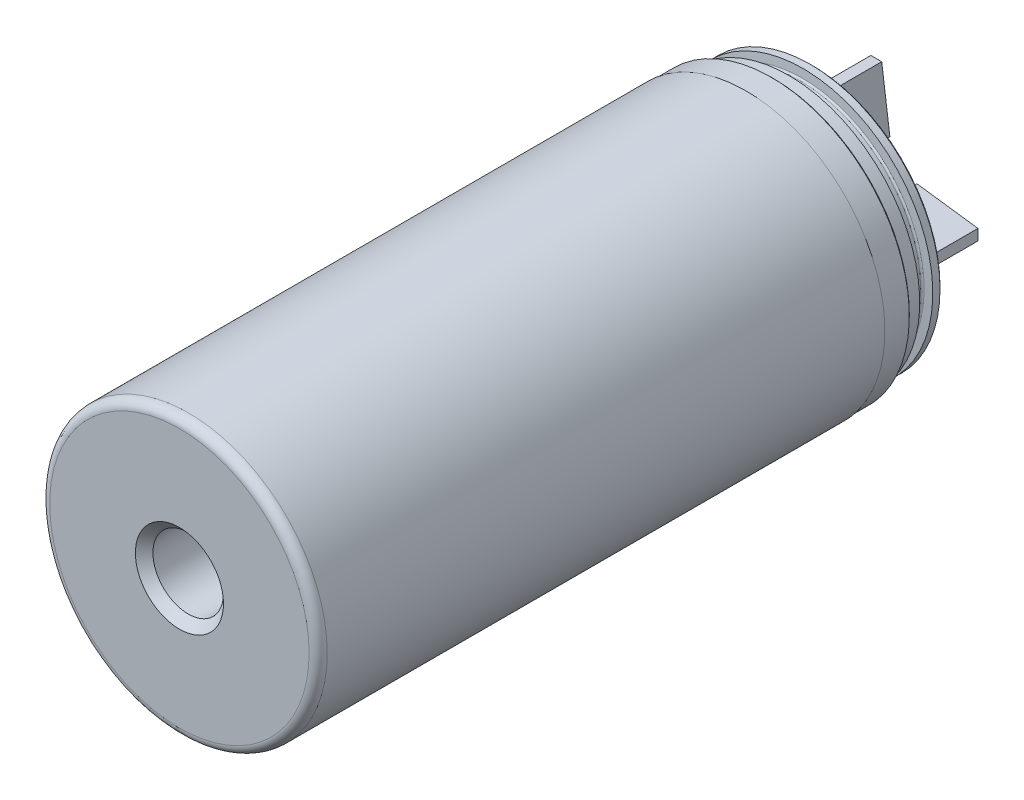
ISO-10303-21;
HEADER;
FILE_DESCRIPTION(('STEP AP214'),'2;1');
FILE_NAME('part.step','',(''),(''),'','','');
FILE_SCHEMA(('AUTOMOTIVE_DESIGN { 1 0 10303 214 1 1 1 1 }'));
ENDSEC;
DATA;
#1=APPLICATION_CONTEXT('core data for automotive mechanical design processes');
#2=APPLICATION_PROTOCOL_DEFINITION('international standard','automotive_design',2000,#1);
#3=PRODUCT_CONTEXT('',#1,'mechanical');
#4=PRODUCT('Part','Part','',(#3));
#5=PRODUCT_RELATED_PRODUCT_CATEGORY('part','',(#4));
#6=PRODUCT_DEFINITION_FORMATION('','',#4);
#7=PRODUCT_DEFINITION_CONTEXT('part definition',#1,'design');
#8=PRODUCT_DEFINITION('design','',#6,#7);
#9=PRODUCT_DEFINITION_SHAPE('','',#8);
#10=(LENGTH_UNIT() NAMED_UNIT(*) SI_UNIT(.MILLI.,.METRE.));
#11=(NAMED_UNIT(*) PLANE_ANGLE_UNIT() SI_UNIT($,.RADIAN.));
#12=(NAMED_UNIT(*) SI_UNIT($,.STERADIAN.) SOLID_ANGLE_UNIT());
#13=UNCERTAINTY_MEASURE_WITH_UNIT(LENGTH_MEASURE(1.E-05),#10,'distance_accuracy_value','');
#14=(GEOMETRIC_REPRESENTATION_CONTEXT(3) GLOBAL_UNCERTAINTY_ASSIGNED_CONTEXT((#13)) GLOBAL_UNIT_ASSIGNED_CONTEXT((#10,
#11,#12)) REPRESENTATION_CONTEXT('',''));
#15=CARTESIAN_POINT('',(0.,0.,0.));
#16=DIRECTION('',(0.,0.,1.));
#17=DIRECTION('',(1.,0.,0.));
#18=AXIS2_PLACEMENT_3D('',#15,#16,#17);
#19=CARTESIAN_POINT('',(0.,0.,-20.601139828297));
#20=DIRECTION('',(0.,0.,-1.));
#21=DIRECTION('',(-1.,0.,0.));
#22=AXIS2_PLACEMENT_3D('',#19,#20,#21);
#23=CYLINDRICAL_SURFACE('',#22,6.096);
#24=CARTESIAN_POINT('',(0.,0.,-3.302));
#25=DIRECTION('',(0.,0.,-1.));
#26=DIRECTION('',(-1.,0.,0.));
#27=AXIS2_PLACEMENT_3D('',#24,#25,#26);
#28=CIRCLE('',#27,6.096);
#29=CARTESIAN_POINT('',(-6.04818749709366,0.761999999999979,-3.302));
#30=VERTEX_POINT('',#29);
#31=CARTESIAN_POINT('',(-0.762,6.04818749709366,-3.302));
#32=VERTEX_POINT('',#31);
#33=EDGE_CURVE('E573',#30,#32,#28,.T.);
#34=ORIENTED_EDGE('',*,*,#33,.F.);
#35=DIRECTION('',(0.,0.,-1.));
#36=VECTOR('',#35,1.);
#37=CARTESIAN_POINT('',(-6.04818749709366,0.761999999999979,-20.601139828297));
#38=LINE('',#37,#36);
#39=CARTESIAN_POINT('',(-6.04818749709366,0.761999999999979,-0.508000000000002));
#40=VERTEX_POINT('',#39);
#41=EDGE_CURVE('E983',#30,#40,#38,.F.);
#42=ORIENTED_EDGE('',*,*,#41,.T.);
#43=CARTESIAN_POINT('',(0.,0.,-0.508000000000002));
#44=DIRECTION('',(0.,0.,-1.));
#45=DIRECTION('',(-1.,0.,0.));
#46=AXIS2_PLACEMENT_3D('',#43,#44,#45);
#47=CIRCLE('',#46,6.096);
#48=CARTESIAN_POINT('',(-0.762,6.04818749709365,-0.508000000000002));
#49=VERTEX_POINT('',#48);
#50=EDGE_CURVE('E572',#40,#49,#47,.T.);
#51=ORIENTED_EDGE('',*,*,#50,.T.);
#52=DIRECTION('',(0.,0.,-1.));
#53=VECTOR('',#52,1.);
#54=CARTESIAN_POINT('',(-0.762,6.04818749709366,-20.601139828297));
#55=LINE('',#54,#53);
#56=EDGE_CURVE('E493',#32,#49,#55,.F.);
#57=ORIENTED_EDGE('',*,*,#56,.F.);
#58=EDGE_LOOP('',(#34,#42,#51,#57));
#59=FACE_BOUND('',#58,.T.);
#60=ADVANCED_FACE('F47',(#59),#23,.T.);
#61=CARTESIAN_POINT('',(0.762,6.04818749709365,-0.508000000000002));
#62=VERTEX_POINT('',#61);
#63=CARTESIAN_POINT('',(6.04818749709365,0.762000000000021,-0.508000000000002));
#64=VERTEX_POINT('',#63);
#65=EDGE_CURVE('E579',#62,#64,#47,.T.);
#66=ORIENTED_EDGE('',*,*,#65,.T.);
#67=DIRECTION('',(0.,0.,-1.));
#68=VECTOR('',#67,1.);
#69=CARTESIAN_POINT('',(6.04818749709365,0.762000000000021,-20.601139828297));
#70=LINE('',#69,#68);
#71=CARTESIAN_POINT('',(6.04818749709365,0.762000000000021,-3.302));
#72=VERTEX_POINT('',#71);
#73=EDGE_CURVE('E421',#64,#72,#70,.T.);
#74=ORIENTED_EDGE('',*,*,#73,.T.);
#75=CARTESIAN_POINT('',(0.762,6.04818749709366,-3.302));
#76=VERTEX_POINT('',#75);
#77=EDGE_CURVE('E568',#76,#72,#28,.T.);
#78=ORIENTED_EDGE('',*,*,#77,.F.);
#79=DIRECTION('',(0.,0.,-1.));
#80=VECTOR('',#79,1.);
#81=CARTESIAN_POINT('',(0.762,6.04818749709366,-20.601139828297));
#82=LINE('',#81,#80);
#83=EDGE_CURVE('E1007',#76,#62,#82,.F.);
#84=ORIENTED_EDGE('',*,*,#83,.T.);
#85=EDGE_LOOP('',(#66,#74,#78,#84));
#86=FACE_BOUND('',#85,.T.);
#87=ADVANCED_FACE('F536',(#86),#23,.T.);
#88=DIRECTION('',(0.,0.,-1.));
#89=VECTOR('',#88,1.);
#90=CARTESIAN_POINT('',(-6.04818749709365,-0.762000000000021,-20.601139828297));
#91=LINE('',#90,#89);
#92=CARTESIAN_POINT('',(-6.04818749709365,-0.762000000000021,-3.302));
#93=VERTEX_POINT('',#92);
#94=CARTESIAN_POINT('',(-6.04818749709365,-0.762000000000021,-0.508000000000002));
#95=VERTEX_POINT('',#94);
#96=EDGE_CURVE('E446',#93,#95,#91,.F.);
#97=ORIENTED_EDGE('',*,*,#96,.F.);
#98=CARTESIAN_POINT('',(-0.762,-6.04818749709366,-3.302));
#99=VERTEX_POINT('',#98);
#100=EDGE_CURVE('E569',#99,#93,#28,.T.);
#101=ORIENTED_EDGE('',*,*,#100,.F.);
#102=DIRECTION('',(0.,0.,-1.));
#103=VECTOR('',#102,1.);
#104=CARTESIAN_POINT('',(-0.762,-6.04818749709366,-20.601139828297));
#105=LINE('',#104,#103);
#106=CARTESIAN_POINT('',(-0.762,-6.04818749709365,-0.508000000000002));
#107=VERTEX_POINT('',#106);
#108=EDGE_CURVE('E392',#99,#107,#105,.F.);
#109=ORIENTED_EDGE('',*,*,#108,.T.);
#110=EDGE_CURVE('E977',#107,#95,#47,.T.);
#111=ORIENTED_EDGE('',*,*,#110,.T.);
#112=EDGE_LOOP('',(#97,#101,#109,#111));
#113=FACE_BOUND('',#112,.T.);
#114=ADVANCED_FACE('F542',(#113),#23,.T.);
#115=DIRECTION('',(0.,0.,-1.));
#116=VECTOR('',#115,1.);
#117=CARTESIAN_POINT('',(0.762,-6.04818749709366,-20.601139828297));
#118=LINE('',#117,#116);
#119=CARTESIAN_POINT('',(0.762,-6.04818749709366,-3.302));
#120=VERTEX_POINT('',#119);
#121=CARTESIAN_POINT('',(0.762,-6.04818749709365,-0.508000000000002));
#122=VERTEX_POINT('',#121);
#123=EDGE_CURVE('E406',#120,#122,#118,.F.);
#124=ORIENTED_EDGE('',*,*,#123,.F.);
#125=CARTESIAN_POINT('',(6.04818749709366,-0.761999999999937,-3.302));
#126=VERTEX_POINT('',#125);
#127=EDGE_CURVE('E560',#126,#120,#28,.T.);
#128=ORIENTED_EDGE('',*,*,#127,.F.);
#129=DIRECTION('',(0.,0.,-1.));
#130=VECTOR('',#129,1.);
#131=CARTESIAN_POINT('',(6.04818749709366,-0.761999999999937,-20.601139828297));
#132=LINE('',#131,#130);
#133=CARTESIAN_POINT('',(6.04818749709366,-0.761999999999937,-0.508000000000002));
#134=VERTEX_POINT('',#133);
#135=EDGE_CURVE('E267',#126,#134,#132,.F.);
#136=ORIENTED_EDGE('',*,*,#135,.T.);
#137=EDGE_CURVE('E562',#134,#122,#47,.T.);
#138=ORIENTED_EDGE('',*,*,#137,.T.);
#139=EDGE_LOOP('',(#124,#128,#136,#138));
#140=FACE_BOUND('',#139,.T.);
#141=ADVANCED_FACE('F538',(#140),#23,.T.);
#142=CARTESIAN_POINT('',(0.,0.,-4.445));
#143=DIRECTION('',(0.,0.,1.));
#144=DIRECTION('',(1.,0.,0.));
#145=AXIS2_PLACEMENT_3D('',#142,#143,#144);
#146=CONICAL_SURFACE('',#145,4.7625,0.862170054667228);
#147=ORIENTED_EDGE('',*,*,#77,.T.);
#148=CARTESIAN_POINT('',(13.4434765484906,0.762000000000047,3.01433284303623));
#149=CARTESIAN_POINT('',(12.9446945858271,0.762000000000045,2.58749766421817));
#150=CARTESIAN_POINT('',(12.4458816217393,0.762000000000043,2.16069869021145));
#151=CARTESIAN_POINT('',(11.4481308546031,0.76200000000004,1.30721397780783));
#152=CARTESIAN_POINT('',(10.9491930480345,0.762000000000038,0.880528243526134));
#153=CARTESIAN_POINT('',(9.9508073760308,0.762000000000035,0.0270352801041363));
#154=CARTESIAN_POINT('',(9.45135940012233,0.762000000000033,-0.399771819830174));
#155=CARTESIAN_POINT('',(8.45223135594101,0.762000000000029,-1.2530820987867));
#156=CARTESIAN_POINT('',(7.95255129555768,0.762000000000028,-1.67958528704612));
#157=CARTESIAN_POINT('',(6.98158317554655,0.762000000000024,-2.50753441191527));
#158=CARTESIAN_POINT('',(6.51031853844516,0.762000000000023,-2.90900779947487));
#159=CARTESIAN_POINT('',(5.80287025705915,0.76200000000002,-3.51061590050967));
#160=CARTESIAN_POINT('',(5.56695084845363,0.762000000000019,-3.71106128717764));
#161=CARTESIAN_POINT('',(5.09485565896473,0.762000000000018,-4.11164488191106));
#162=CARTESIAN_POINT('',(4.85867988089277,0.762000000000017,-4.31178309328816));
#163=CARTESIAN_POINT('',(4.38604430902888,0.762000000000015,-4.71150394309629));
#164=CARTESIAN_POINT('',(4.14958469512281,0.762000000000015,-4.91108679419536));
#165=CARTESIAN_POINT('',(3.67602910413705,0.762000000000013,-5.30951723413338));
#166=CARTESIAN_POINT('',(3.43893310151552,0.762000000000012,-5.5083647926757));
#167=CARTESIAN_POINT('',(3.08245982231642,0.762000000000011,-5.80560095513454));
#168=CARTESIAN_POINT('',(2.96350734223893,0.76200000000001,-5.90449877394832));
#169=CARTESIAN_POINT('',(2.72519958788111,0.76200000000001,-6.10180764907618));
#170=CARTESIAN_POINT('',(2.60584431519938,0.762000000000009,-6.20021870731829));
#171=CARTESIAN_POINT('',(2.36655542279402,0.762000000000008,-6.39631964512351));
#172=CARTESIAN_POINT('',(2.24662184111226,0.762000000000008,-6.49400957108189));
#173=CARTESIAN_POINT('',(2.00586397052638,0.762000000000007,-6.68828457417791));
#174=CARTESIAN_POINT('',(1.88503970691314,0.762000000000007,-6.78486968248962));
#175=CARTESIAN_POINT('',(1.73551037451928,0.762000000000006,-6.90251876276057));
#176=CARTESIAN_POINT('',(1.7075054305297,0.762000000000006,-6.92447244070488));
#177=CARTESIAN_POINT('',(1.65140419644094,0.762000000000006,-6.96826303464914));
#178=CARTESIAN_POINT('',(1.6233079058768,0.762000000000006,-6.99009995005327));
#179=CARTESIAN_POINT('',(1.53885948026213,0.762000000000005,-7.05541536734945));
#180=CARTESIAN_POINT('',(1.48235277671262,0.762000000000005,-7.09869460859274));
#181=CARTESIAN_POINT('',(1.36837233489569,0.762000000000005,-7.18485648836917));
#182=CARTESIAN_POINT('',(1.31089452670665,0.762000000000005,-7.22773375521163));
#183=CARTESIAN_POINT('',(1.19520593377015,0.762000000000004,-7.31246041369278));
#184=CARTESIAN_POINT('',(1.13699534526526,0.762000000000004,-7.35431007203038));
#185=CARTESIAN_POINT('',(1.01911247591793,0.762000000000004,-7.43683007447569));
#186=CARTESIAN_POINT('',(0.959432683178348,0.762000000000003,-7.47748974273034));
#187=CARTESIAN_POINT('',(0.838486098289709,0.762000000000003,-7.55657591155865));
#188=CARTESIAN_POINT('',(0.777217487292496,0.762000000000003,-7.59499967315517));
#189=CARTESIAN_POINT('',(0.652916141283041,0.762000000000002,-7.66790703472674));
#190=CARTESIAN_POINT('',(0.589898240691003,0.762000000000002,-7.70241565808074));
#191=CARTESIAN_POINT('',(0.460847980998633,0.762000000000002,-7.76519615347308));
#192=CARTESIAN_POINT('',(0.394824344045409,0.762000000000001,-7.79348483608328));
#193=CARTESIAN_POINT('',(0.300527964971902,0.762000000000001,-7.8253436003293));
#194=CARTESIAN_POINT('',(0.273803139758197,0.762000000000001,-7.83346384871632));
#195=CARTESIAN_POINT('',(0.219821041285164,0.762000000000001,-7.8477226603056));
#196=CARTESIAN_POINT('',(0.192563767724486,0.762000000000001,-7.85386122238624));
#197=CARTESIAN_POINT('',(0.137755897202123,0.762,-7.86380727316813));
#198=CARTESIAN_POINT('',(0.110207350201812,0.762,-7.8676258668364));
#199=CARTESIAN_POINT('',(0.0548673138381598,0.762,-7.87273347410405));
#200=CARTESIAN_POINT('',(0.0270757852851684,0.762,-7.87402207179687));
#201=CARTESIAN_POINT('',(-0.0286150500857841,0.762,-7.87397726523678));
#202=CARTESIAN_POINT('',(-0.0565143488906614,0.762,-7.87263348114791));
#203=CARTESIAN_POINT('',(-0.112063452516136,0.762,-7.86739911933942));
#204=CARTESIAN_POINT('',(-0.139713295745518,0.762,-7.8635089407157));
#205=CARTESIAN_POINT('',(-0.194710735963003,0.761999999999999,-7.85340992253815));
#206=CARTESIAN_POINT('',(-0.222056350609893,0.761999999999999,-7.84719047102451));
#207=CARTESIAN_POINT('',(-0.276209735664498,0.761999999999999,-7.832764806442));
#208=CARTESIAN_POINT('',(-0.303017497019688,0.761999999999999,-7.82455855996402));
#209=CARTESIAN_POINT('',(-0.397630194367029,0.761999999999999,-7.79238140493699));
#210=CARTESIAN_POINT('',(-0.463874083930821,0.761999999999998,-7.7638524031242));
#211=CARTESIAN_POINT('',(-0.593353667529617,0.761999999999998,-7.70059931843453));
#212=CARTESIAN_POINT('',(-0.656580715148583,0.761999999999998,-7.66585864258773));
#213=CARTESIAN_POINT('',(-0.781415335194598,0.761999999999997,-7.59242974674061));
#214=CARTESIAN_POINT('',(-0.843004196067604,0.761999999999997,-7.55371001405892));
#215=CARTESIAN_POINT('',(-0.934199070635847,0.761999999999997,-7.49394059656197));
#216=CARTESIAN_POINT('',(-0.964379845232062,0.761999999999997,-7.47374964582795));
#217=CARTESIAN_POINT('',(-1.02442250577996,0.761999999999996,-7.43289954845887));
#218=CARTESIAN_POINT('',(-1.05428440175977,0.761999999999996,-7.41224041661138));
#219=CARTESIAN_POINT('',(-1.15306926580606,0.761999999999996,-7.34297404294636));
#220=CARTESIAN_POINT('',(-1.22141401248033,0.761999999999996,-7.29354362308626));
#221=CARTESIAN_POINT('',(-1.35714563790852,0.761999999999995,-7.19338161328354));
#222=CARTESIAN_POINT('',(-1.42453242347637,0.761999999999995,-7.14264989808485));
#223=CARTESIAN_POINT('',(-1.55864343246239,0.761999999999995,-7.0402821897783));
#224=CARTESIAN_POINT('',(-1.62536746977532,0.761999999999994,-6.98864595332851));
#225=CARTESIAN_POINT('',(-1.75831914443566,0.761999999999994,-6.88473756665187));
#226=CARTESIAN_POINT('',(-1.82454677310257,0.761999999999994,-6.83246540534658));
#227=CARTESIAN_POINT('',(-2.02283964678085,0.761999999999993,-6.67483111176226));
#228=CARTESIAN_POINT('',(-2.15435337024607,0.761999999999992,-6.56877592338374));
#229=CARTESIAN_POINT('',(-2.41648647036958,0.761999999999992,-6.35561503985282));
#230=CARTESIAN_POINT('',(-2.54710599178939,0.761999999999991,-6.24850952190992));
#231=CARTESIAN_POINT('',(-2.80678117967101,0.76199999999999,-6.03443184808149));
#232=CARTESIAN_POINT('',(-2.93584116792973,0.76199999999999,-5.92746493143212));
#233=CARTESIAN_POINT('',(-3.19358437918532,0.761999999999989,-5.71306730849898));
#234=CARTESIAN_POINT('',(-3.32226758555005,0.761999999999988,-5.60563658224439));
#235=CARTESIAN_POINT('',(-3.70775326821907,0.761999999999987,-5.28299897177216));
#236=CARTESIAN_POINT('',(-3.96415397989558,0.761999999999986,-5.06731229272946));
#237=CARTESIAN_POINT('',(-4.60373895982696,0.761999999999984,-4.52781793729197));
#238=CARTESIAN_POINT('',(-4.98656232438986,0.761999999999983,-4.20358307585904));
#239=CARTESIAN_POINT('',(-5.75156936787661,0.76199999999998,-3.55435516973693));
#240=CARTESIAN_POINT('',(-6.13375304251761,0.761999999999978,-3.22936212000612));
#241=CARTESIAN_POINT('',(-6.89785350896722,0.761999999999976,-2.57885178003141));
#242=CARTESIAN_POINT('',(-7.27977019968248,0.761999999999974,-2.25333437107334));
#243=CARTESIAN_POINT('',(-8.04337180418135,0.761999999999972,-1.60202958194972));
#244=CARTESIAN_POINT('',(-8.42505671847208,0.76199999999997,-1.2762422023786));
#245=CARTESIAN_POINT('',(-9.57999982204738,0.761999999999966,-0.289981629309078));
#246=CARTESIAN_POINT('',(-10.3530256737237,0.761999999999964,0.370763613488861));
#247=CARTESIAN_POINT('',(-11.5122287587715,0.76199999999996,1.36205027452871));
#248=CARTESIAN_POINT('',(-11.8985186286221,0.761999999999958,1.69246003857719));
#249=CARTESIAN_POINT('',(-12.6710385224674,0.761999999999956,2.35334890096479));
#250=CARTESIAN_POINT('',(-13.0572685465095,0.761999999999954,2.68382799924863));
#251=CARTESIAN_POINT('',(-13.4434765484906,0.761999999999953,3.01433284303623));
#252=B_SPLINE_CURVE_WITH_KNOTS('',3,(#148,#149,#150,#151,#152,#153,#154,#155,#156,#157,#158,
#159,#160,#161,#162,#163,#164,#165,#166,#167,#168,#169,#170,#171,#172,#173,#174,#175,#176,#177,
#178,#179,#180,#181,#182,#183,#184,#185,#186,#187,#188,#189,#190,#191,#192,#193,#194,#195,#196,
#197,#198,#199,#200,#201,#202,#203,#204,#205,#206,#207,#208,#209,#210,#211,#212,#213,#214,#215,
#216,#217,#218,#219,#220,#221,#222,#223,#224,#225,#226,#227,#228,#229,#230,#231,#232,#233,#234,
#235,#236,#237,#238,#239,#240,#241,#242,#243,#244,#245,#246,#247,#248,#249,#250,#251),
.UNSPECIFIED.,.F.,.F.,(4,2,2,2,2,2,2,2,2,2,2,2,2,2,2,2,2,2,2,2,2,2,2,2,2,2,2,2,2,2,2,2,2,2,2,2,
2,2,2,2,2,2,2,2,2,2,2,2,2,2,2,4),(0.,1.96945310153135,3.93896999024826,5.90988675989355,
7.880740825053,9.73800730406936,10.6667304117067,11.595443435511,12.5237306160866,
13.4520556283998,13.9161391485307,14.3802208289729,14.8442723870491,15.3083108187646,
15.4150633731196,15.5218164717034,15.7353417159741,15.9504607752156,16.1655234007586,
16.3821363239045,16.599009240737,16.8144069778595,17.0292152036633,17.1129474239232,
17.1966796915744,17.2800079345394,17.3633498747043,17.4470211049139,17.5306792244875,
17.6147232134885,17.6987686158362,17.9144691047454,18.1307546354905,18.3489088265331,
18.4578428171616,18.5667733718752,18.8197859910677,19.0728230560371,19.3259292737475,
19.579039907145,20.0858733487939,20.5926227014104,21.0954983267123,21.5983958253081,
22.6035590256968,24.1085945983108,25.6136402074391,27.1190959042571,28.6245482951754,
31.6753477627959,33.2003114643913,34.7252739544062),.UNSPECIFIED.);
#253=CARTESIAN_POINT('',(4.70114478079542,0.762000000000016,-4.445));
#254=VERTEX_POINT('',#253);
#255=EDGE_CURVE('E413',#72,#254,#252,.T.);
#256=ORIENTED_EDGE('',*,*,#255,.T.);
#257=CARTESIAN_POINT('',(0.,0.,-4.445));
#258=DIRECTION('',(0.,0.,-1.));
#259=DIRECTION('',(-1.,0.,0.));
#260=AXIS2_PLACEMENT_3D('',#257,#258,#259);
#261=CIRCLE('',#260,4.7625);
#262=CARTESIAN_POINT('',(0.762,4.70114478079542,-4.445));
#263=VERTEX_POINT('',#262);
#264=EDGE_CURVE('E577',#263,#254,#261,.T.);
#265=ORIENTED_EDGE('',*,*,#264,.F.);
#266=CARTESIAN_POINT('',(0.762,-3.7215383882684,-5.27107251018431));
#267=CARTESIAN_POINT('',(0.762,-3.61802126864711,-5.35799176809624));
#268=CARTESIAN_POINT('',(0.762,-3.51443802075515,-5.44483254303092));
#269=CARTESIAN_POINT('',(0.762,-3.30708109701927,-5.61829443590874));
#270=CARTESIAN_POINT('',(0.762,-3.20330741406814,-5.70491554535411));
#271=CARTESIAN_POINT('',(0.762,-2.99534586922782,-5.87801316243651));
#272=CARTESIAN_POINT('',(0.762,-2.89115760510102,-5.96448918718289));
#273=CARTESIAN_POINT('',(0.762,-2.6824564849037,-6.13704218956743));
#274=CARTESIAN_POINT('',(0.762,-2.57794363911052,-6.22311917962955));
#275=CARTESIAN_POINT('',(0.762,-2.3638100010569,-6.39852763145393));
#276=CARTESIAN_POINT('',(0.762,-2.25416849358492,-6.48783385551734));
#277=CARTESIAN_POINT('',(0.762,-2.03413777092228,-6.66554333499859));
#278=CARTESIAN_POINT('',(0.762,-1.92374848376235,-6.75394650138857));
#279=CARTESIAN_POINT('',(0.762,-1.7019285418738,-6.92923765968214));
#280=CARTESIAN_POINT('',(0.762,-1.59049892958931,-7.01612696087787));
#281=CARTESIAN_POINT('',(0.762,-1.42191349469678,-7.14455427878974));
#282=CARTESIAN_POINT('',(0.762,-1.36548276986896,-7.18704227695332));
#283=CARTESIAN_POINT('',(0.762,-1.25196578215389,-7.27113148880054));
#284=CARTESIAN_POINT('',(0.762,-1.19487954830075,-7.31273274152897));
#285=CARTESIAN_POINT('',(0.762,-1.08345952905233,-7.39207439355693));
#286=CARTESIAN_POINT('',(0.762,-1.02918113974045,-7.42989221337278));
#287=CARTESIAN_POINT('',(0.762,-0.919505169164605,-7.50394709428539));
#288=CARTESIAN_POINT('',(0.762,-0.864106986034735,-7.5401832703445));
#289=CARTESIAN_POINT('',(0.762,-0.751909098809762,-7.61014832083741));
#290=CARTESIAN_POINT('',(0.762,-0.695113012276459,-7.64388291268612));
#291=CARTESIAN_POINT('',(0.762,-0.579441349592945,-7.70749811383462));
#292=CARTESIAN_POINT('',(0.762,-0.520568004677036,-7.73738270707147));
#293=CARTESIAN_POINT('',(0.762,-0.403231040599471,-7.78936692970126));
#294=CARTESIAN_POINT('',(0.762,-0.344926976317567,-7.81180726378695));
#295=CARTESIAN_POINT('',(0.762,-0.255595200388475,-7.83864569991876));
#296=CARTESIAN_POINT('',(0.762,-0.225596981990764,-7.84644172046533));
#297=CARTESIAN_POINT('',(0.762,-0.165033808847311,-7.85932959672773));
#298=CARTESIAN_POINT('',(0.762,-0.134469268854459,-7.86442335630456));
#299=CARTESIAN_POINT('',(0.762,-0.0724548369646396,-7.87159075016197));
#300=CARTESIAN_POINT('',(0.762,-0.0409987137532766,-7.87361185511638));
#301=CARTESIAN_POINT('',(0.762,0.0219479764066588,-7.87428608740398));
#302=CARTESIAN_POINT('',(0.762,0.0534385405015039,-7.87293947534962));
#303=CARTESIAN_POINT('',(0.762,0.116229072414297,-7.86699010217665));
#304=CARTESIAN_POINT('',(0.762,0.147527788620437,-7.86237444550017));
#305=CARTESIAN_POINT('',(0.762,0.209554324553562,-7.85024758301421));
#306=CARTESIAN_POINT('',(0.762,0.240281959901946,-7.8427354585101));
#307=CARTESIAN_POINT('',(0.762,0.326206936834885,-7.81808839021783));
#308=CARTESIAN_POINT('',(0.762,0.380589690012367,-7.79813691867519));
#309=CARTESIAN_POINT('',(0.762,0.487120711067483,-7.75296915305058));
#310=CARTESIAN_POINT('',(0.762,0.539264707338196,-7.72774329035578));
#311=CARTESIAN_POINT('',(0.762,0.642230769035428,-7.67367681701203));
#312=CARTESIAN_POINT('',(0.762,0.693036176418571,-7.64480497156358));
#313=CARTESIAN_POINT('',(0.762,0.793234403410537,-7.58483795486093));
#314=CARTESIAN_POINT('',(0.762,0.842628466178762,-7.55374483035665));
#315=CARTESIAN_POINT('',(0.762,0.945598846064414,-7.48665250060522));
#316=CARTESIAN_POINT('',(0.762,0.999063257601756,-7.45048267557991));
#317=CARTESIAN_POINT('',(0.762,1.10510646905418,-7.37686304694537));
#318=CARTESIAN_POINT('',(0.762,1.1576851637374,-7.33941309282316));
#319=CARTESIAN_POINT('',(0.762,1.31449243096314,-7.22569933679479));
#320=CARTESIAN_POINT('',(0.762,1.41774962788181,-7.14810034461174));
#321=CARTESIAN_POINT('',(0.762,1.62292038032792,-6.99085989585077));
#322=CARTESIAN_POINT('',(0.762,1.7248317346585,-6.91121560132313));
#323=CARTESIAN_POINT('',(0.762,1.92768305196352,-6.75075030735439));
#324=CARTESIAN_POINT('',(0.762,2.02862324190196,-6.66992959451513));
#325=CARTESIAN_POINT('',(0.762,2.22926342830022,-6.5080063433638));
#326=CARTESIAN_POINT('',(0.762,2.32896723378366,-6.42690851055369));
#327=CARTESIAN_POINT('',(0.762,2.52794594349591,-6.26417640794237));
#328=CARTESIAN_POINT('',(0.762,2.62722082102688,-6.18254210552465));
#329=CARTESIAN_POINT('',(0.762,2.92441197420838,-5.93721577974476));
#330=CARTESIAN_POINT('',(0.762,3.12186445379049,-5.77296241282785));
#331=CARTESIAN_POINT('',(0.762,3.59068713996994,-5.3812996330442));
#332=CARTESIAN_POINT('',(0.762,3.86174598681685,-5.15351836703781));
#333=CARTESIAN_POINT('',(0.762,4.40316829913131,-4.6971262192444));
#334=CARTESIAN_POINT('',(0.762,4.67353175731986,-4.46851532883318));
#335=CARTESIAN_POINT('',(0.762,5.21393889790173,-4.01071464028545));
#336=CARTESIAN_POINT('',(0.762,5.48398242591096,-3.78152465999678));
#337=CARTESIAN_POINT('',(0.762,6.02379840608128,-3.32282777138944));
#338=CARTESIAN_POINT('',(0.762,6.2935708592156,-3.0933208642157));
#339=CARTESIAN_POINT('',(0.762,7.10624793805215,-2.40139432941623));
#340=CARTESIAN_POINT('',(0.762,7.64887853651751,-1.93865290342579));
#341=CARTESIAN_POINT('',(0.762,8.46243985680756,-1.24430583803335));
#342=CARTESIAN_POINT('',(0.762,8.73350971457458,-1.01286309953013));
#343=CARTESIAN_POINT('',(0.762,9.27557506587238,-0.549891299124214));
#344=CARTESIAN_POINT('',(0.762,9.54657055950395,-0.318362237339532));
#345=CARTESIAN_POINT('',(0.762,9.8175383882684,-0.0868007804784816));
#346=B_SPLINE_CURVE_WITH_KNOTS('',3,(#266,#267,#268,#269,#270,#271,#272,#273,#274,#275,#276,
#277,#278,#279,#280,#281,#282,#283,#284,#285,#286,#287,#288,#289,#290,#291,#292,#293,#294,#295,
#296,#297,#298,#299,#300,#301,#302,#303,#304,#305,#306,#307,#308,#309,#310,#311,#312,#313,#314,
#315,#316,#317,#318,#319,#320,#321,#322,#323,#324,#325,#326,#327,#328,#329,#330,#331,#332,#333,
#334,#335,#336,#337,#338,#339,#340,#341,#342,#343,#344,#345),.UNSPECIFIED.,.F.,.F.,(4,2,2,2,2,2,
2,2,2,2,2,2,2,2,2,2,2,2,2,2,2,2,2,2,2,2,2,2,2,2,2,2,2,2,2,2,2,2,2,4),(0.,0.405508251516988,
0.81103195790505,1.21723272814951,1.6234207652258,2.0476479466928,2.47191655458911,
2.89579792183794,3.10770457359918,3.31960187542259,3.51804414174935,3.71659606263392,
3.91467923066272,4.11255574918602,4.29941947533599,4.39230238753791,4.48511977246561,
4.57950677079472,4.67388646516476,4.7686405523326,4.8634247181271,5.03672292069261,
5.21033828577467,5.38555720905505,5.56061671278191,5.75423900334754,5.94788413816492,
6.33532830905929,6.72334270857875,7.1112641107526,7.49682561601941,7.88241078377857,
8.65292513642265,9.71509684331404,10.7772796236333,11.839853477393,12.9024235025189,
15.0418616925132,16.111161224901,17.18045930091),.UNSPECIFIED.);
#347=EDGE_CURVE('E1011',#263,#76,#346,.T.);
#348=ORIENTED_EDGE('',*,*,#347,.T.);
#349=EDGE_LOOP('',(#147,#256,#265,#348));
#350=FACE_BOUND('',#349,.T.);
#351=ADVANCED_FACE('F357',(#350),#146,.T.);
#352=CARTESIAN_POINT('',(-4.70114478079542,0.761999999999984,-4.445));
#353=VERTEX_POINT('',#352);
#354=CARTESIAN_POINT('',(-0.762,4.70114478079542,-4.445));
#355=VERTEX_POINT('',#354);
#356=EDGE_CURVE('E1014',#353,#355,#261,.T.);
#357=ORIENTED_EDGE('',*,*,#356,.F.);
#358=EDGE_CURVE('E62',#353,#30,#252,.T.);
#359=ORIENTED_EDGE('',*,*,#358,.T.);
#360=ORIENTED_EDGE('',*,*,#33,.T.);
#361=CARTESIAN_POINT('',(-0.762,-3.7215383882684,-5.27107251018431));
#362=CARTESIAN_POINT('',(-0.762,-3.61802126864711,-5.35799176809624));
#363=CARTESIAN_POINT('',(-0.762,-3.51443802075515,-5.44483254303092));
#364=CARTESIAN_POINT('',(-0.762,-3.30708109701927,-5.61829443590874));
#365=CARTESIAN_POINT('',(-0.762,-3.20330741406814,-5.70491554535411));
#366=CARTESIAN_POINT('',(-0.762,-2.99534586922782,-5.87801316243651));
#367=CARTESIAN_POINT('',(-0.762,-2.89115760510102,-5.96448918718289));
#368=CARTESIAN_POINT('',(-0.762,-2.6824564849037,-6.13704218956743));
#369=CARTESIAN_POINT('',(-0.762,-2.57794363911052,-6.22311917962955));
#370=CARTESIAN_POINT('',(-0.762,-2.3638100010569,-6.39852763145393));
#371=CARTESIAN_POINT('',(-0.762,-2.25416849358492,-6.48783385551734));
#372=CARTESIAN_POINT('',(-0.762,-2.03413777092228,-6.66554333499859));
#373=CARTESIAN_POINT('',(-0.762,-1.92374848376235,-6.75394650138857));
#374=CARTESIAN_POINT('',(-0.762,-1.7019285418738,-6.92923765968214));
#375=CARTESIAN_POINT('',(-0.762,-1.59049892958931,-7.01612696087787));
#376=CARTESIAN_POINT('',(-0.762,-1.42191349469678,-7.14455427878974));
#377=CARTESIAN_POINT('',(-0.762,-1.36548276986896,-7.18704227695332));
#378=CARTESIAN_POINT('',(-0.762,-1.25196578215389,-7.27113148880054));
#379=CARTESIAN_POINT('',(-0.762,-1.19487954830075,-7.31273274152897));
#380=CARTESIAN_POINT('',(-0.762,-1.08345952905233,-7.39207439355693));
#381=CARTESIAN_POINT('',(-0.762,-1.02918113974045,-7.42989221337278));
#382=CARTESIAN_POINT('',(-0.762,-0.919505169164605,-7.50394709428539));
#383=CARTESIAN_POINT('',(-0.762,-0.864106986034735,-7.5401832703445));
#384=CARTESIAN_POINT('',(-0.762,-0.751909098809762,-7.61014832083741));
#385=CARTESIAN_POINT('',(-0.762,-0.695113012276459,-7.64388291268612));
#386=CARTESIAN_POINT('',(-0.762,-0.579441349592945,-7.70749811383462));
#387=CARTESIAN_POINT('',(-0.762,-0.520568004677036,-7.73738270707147));
#388=CARTESIAN_POINT('',(-0.762,-0.403231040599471,-7.78936692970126));
#389=CARTESIAN_POINT('',(-0.762,-0.344926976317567,-7.81180726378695));
#390=CARTESIAN_POINT('',(-0.762,-0.255595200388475,-7.83864569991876));
#391=CARTESIAN_POINT('',(-0.762,-0.225596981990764,-7.84644172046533));
#392=CARTESIAN_POINT('',(-0.762,-0.165033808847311,-7.85932959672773));
#393=CARTESIAN_POINT('',(-0.762,-0.134469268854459,-7.86442335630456));
#394=CARTESIAN_POINT('',(-0.762,-0.0724548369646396,-7.87159075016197));
#395=CARTESIAN_POINT('',(-0.762,-0.0409987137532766,-7.87361185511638));
#396=CARTESIAN_POINT('',(-0.762,0.0219479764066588,-7.87428608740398));
#397=CARTESIAN_POINT('',(-0.762,0.0534385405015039,-7.87293947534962));
#398=CARTESIAN_POINT('',(-0.762,0.116229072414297,-7.86699010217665));
#399=CARTESIAN_POINT('',(-0.762,0.147527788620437,-7.86237444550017));
#400=CARTESIAN_POINT('',(-0.762,0.209554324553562,-7.85024758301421));
#401=CARTESIAN_POINT('',(-0.762,0.240281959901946,-7.8427354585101));
#402=CARTESIAN_POINT('',(-0.762,0.326206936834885,-7.81808839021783));
#403=CARTESIAN_POINT('',(-0.762,0.380589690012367,-7.79813691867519));
#404=CARTESIAN_POINT('',(-0.762,0.487120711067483,-7.75296915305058));
#405=CARTESIAN_POINT('',(-0.762,0.539264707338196,-7.72774329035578));
#406=CARTESIAN_POINT('',(-0.762,0.642230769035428,-7.67367681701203));
#407=CARTESIAN_POINT('',(-0.762,0.693036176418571,-7.64480497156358));
#408=CARTESIAN_POINT('',(-0.762,0.793234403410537,-7.58483795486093));
#409=CARTESIAN_POINT('',(-0.762,0.842628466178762,-7.55374483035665));
#410=CARTESIAN_POINT('',(-0.762,0.945598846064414,-7.48665250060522));
#411=CARTESIAN_POINT('',(-0.762,0.999063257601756,-7.45048267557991));
#412=CARTESIAN_POINT('',(-0.762,1.10510646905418,-7.37686304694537));
#413=CARTESIAN_POINT('',(-0.762,1.1576851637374,-7.33941309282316));
#414=CARTESIAN_POINT('',(-0.762,1.31449243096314,-7.22569933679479));
#415=CARTESIAN_POINT('',(-0.762,1.41774962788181,-7.14810034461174));
#416=CARTESIAN_POINT('',(-0.762,1.62292038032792,-6.99085989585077));
#417=CARTESIAN_POINT('',(-0.762,1.7248317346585,-6.91121560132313));
#418=CARTESIAN_POINT('',(-0.762,1.92768305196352,-6.75075030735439));
#419=CARTESIAN_POINT('',(-0.762,2.02862324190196,-6.66992959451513));
#420=CARTESIAN_POINT('',(-0.762,2.22926342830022,-6.5080063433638));
#421=CARTESIAN_POINT('',(-0.762,2.32896723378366,-6.42690851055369));
#422=CARTESIAN_POINT('',(-0.762,2.52794594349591,-6.26417640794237));
#423=CARTESIAN_POINT('',(-0.762,2.62722082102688,-6.18254210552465));
#424=CARTESIAN_POINT('',(-0.762,2.92441197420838,-5.93721577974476));
#425=CARTESIAN_POINT('',(-0.762,3.12186445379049,-5.77296241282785));
#426=CARTESIAN_POINT('',(-0.762,3.59068713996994,-5.3812996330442));
#427=CARTESIAN_POINT('',(-0.762,3.86174598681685,-5.15351836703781));
#428=CARTESIAN_POINT('',(-0.762,4.40316829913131,-4.6971262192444));
#429=CARTESIAN_POINT('',(-0.762,4.67353175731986,-4.46851532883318));
#430=CARTESIAN_POINT('',(-0.762,5.21393889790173,-4.01071464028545));
#431=CARTESIAN_POINT('',(-0.762,5.48398242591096,-3.78152465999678));
#432=CARTESIAN_POINT('',(-0.762,6.02379840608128,-3.32282777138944));
#433=CARTESIAN_POINT('',(-0.762,6.2935708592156,-3.0933208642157));
#434=CARTESIAN_POINT('',(-0.762,7.10624793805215,-2.40139432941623));
#435=CARTESIAN_POINT('',(-0.762,7.64887853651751,-1.93865290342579));
#436=CARTESIAN_POINT('',(-0.762,8.46243985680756,-1.24430583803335));
#437=CARTESIAN_POINT('',(-0.762,8.73350971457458,-1.01286309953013));
#438=CARTESIAN_POINT('',(-0.762,9.27557506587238,-0.549891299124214));
#439=CARTESIAN_POINT('',(-0.762,9.54657055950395,-0.318362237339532));
#440=CARTESIAN_POINT('',(-0.762,9.8175383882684,-0.0868007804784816));
#441=B_SPLINE_CURVE_WITH_KNOTS('',3,(#361,#362,#363,#364,#365,#366,#367,#368,#369,#370,#371,
#372,#373,#374,#375,#376,#377,#378,#379,#380,#381,#382,#383,#384,#385,#386,#387,#388,#389,#390,
#391,#392,#393,#394,#395,#396,#397,#398,#399,#400,#401,#402,#403,#404,#405,#406,#407,#408,#409,
#410,#411,#412,#413,#414,#415,#416,#417,#418,#419,#420,#421,#422,#423,#424,#425,#426,#427,#428,
#429,#430,#431,#432,#433,#434,#435,#436,#437,#438,#439,#440),.UNSPECIFIED.,.F.,.F.,(4,2,2,2,2,2,
2,2,2,2,2,2,2,2,2,2,2,2,2,2,2,2,2,2,2,2,2,2,2,2,2,2,2,2,2,2,2,2,2,4),(0.,0.405508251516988,
0.81103195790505,1.21723272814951,1.6234207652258,2.0476479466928,2.47191655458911,
2.89579792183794,3.10770457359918,3.31960187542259,3.51804414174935,3.71659606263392,
3.91467923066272,4.11255574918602,4.29941947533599,4.39230238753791,4.48511977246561,
4.57950677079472,4.67388646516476,4.7686405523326,4.8634247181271,5.03672292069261,
5.21033828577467,5.38555720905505,5.56061671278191,5.75423900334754,5.94788413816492,
6.33532830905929,6.72334270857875,7.1112641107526,7.49682561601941,7.88241078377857,
8.65292513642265,9.71509684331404,10.7772796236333,11.839853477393,12.9024235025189,
15.0418616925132,16.111161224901,17.18045930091),.UNSPECIFIED.);
#442=EDGE_CURVE('E485',#355,#32,#441,.T.);
#443=ORIENTED_EDGE('',*,*,#442,.F.);
#444=EDGE_LOOP('',(#357,#359,#360,#443));
#445=FACE_BOUND('',#444,.T.);
#446=ADVANCED_FACE('F552',(#445),#146,.T.);
#447=CARTESIAN_POINT('',(-0.55250368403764,-0.762000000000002,-7.72037865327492));
#448=CARTESIAN_POINT('',(-0.592784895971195,-0.762000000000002,-7.70007038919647));
#449=CARTESIAN_POINT('',(-0.632491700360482,-0.762000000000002,-7.67868061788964));
#450=CARTESIAN_POINT('',(-0.71093263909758,-0.762000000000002,-7.63424074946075));
#451=CARTESIAN_POINT('',(-0.749667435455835,-0.762000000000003,-7.61119182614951));
#452=CARTESIAN_POINT('',(-0.826327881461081,-0.762000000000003,-7.56394873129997));
#453=CARTESIAN_POINT('',(-0.864254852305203,-0.762000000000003,-7.53975667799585));
#454=CARTESIAN_POINT('',(-0.939528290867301,-0.762000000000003,-7.49047195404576));
#455=CARTESIAN_POINT('',(-0.976874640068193,-0.762000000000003,-7.465379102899));
#456=CARTESIAN_POINT('',(-1.08805631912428,-0.762000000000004,-7.38920210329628));
#457=CARTESIAN_POINT('',(-1.16120161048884,-0.762000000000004,-7.33711356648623));
#458=CARTESIAN_POINT('',(-1.30632802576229,-0.762000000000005,-7.23126892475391));
#459=CARTESIAN_POINT('',(-1.37830844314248,-0.762000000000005,-7.17751186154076));
#460=CARTESIAN_POINT('',(-1.52090480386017,-0.762000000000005,-7.06931846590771));
#461=CARTESIAN_POINT('',(-1.59152693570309,-0.762000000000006,-7.01489027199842));
#462=CARTESIAN_POINT('',(-1.73219165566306,-0.762000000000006,-6.9052890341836));
#463=CARTESIAN_POINT('',(-1.80223423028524,-0.762000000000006,-6.85011597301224));
#464=CARTESIAN_POINT('',(-2.01174230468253,-0.762000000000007,-6.68379873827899));
#465=CARTESIAN_POINT('',(-2.15057904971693,-0.762000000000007,-6.5718635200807));
#466=CARTESIAN_POINT('',(-2.42727829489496,-0.762000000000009,-6.34682081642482));
#467=CARTESIAN_POINT('',(-2.56514086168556,-0.762000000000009,-6.23371341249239));
#468=CARTESIAN_POINT('',(-2.84024467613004,-0.76200000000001,-6.00675783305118));
#469=CARTESIAN_POINT('',(-2.97748595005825,-0.76200000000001,-5.89290968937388));
#470=CARTESIAN_POINT('',(-3.25183213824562,-0.762000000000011,-5.66449142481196));
#471=CARTESIAN_POINT('',(-3.3889362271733,-0.762000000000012,-5.54992031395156));
#472=CARTESIAN_POINT('',(-3.66285485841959,-0.762000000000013,-5.3204296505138));
#473=CARTESIAN_POINT('',(-3.79966939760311,-0.762000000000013,-5.20551009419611));
#474=CARTESIAN_POINT('',(-4.20978986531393,-0.762000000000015,-4.86039010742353));
#475=CARTESIAN_POINT('',(-4.48278380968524,-0.762000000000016,-4.62981903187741));
#476=CARTESIAN_POINT('',(-4.86417105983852,-0.762000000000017,-4.30702860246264));
#477=CARTESIAN_POINT('',(-4.97276360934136,-0.762000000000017,-4.21504425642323));
#478=CARTESIAN_POINT('',(-5.18982836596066,-0.762000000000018,-4.03104645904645));
#479=CARTESIAN_POINT('',(-5.29830060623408,-0.762000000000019,-3.93903304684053));
#480=CARTESIAN_POINT('',(-5.80067432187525,-0.76200000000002,-3.51264367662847));
#481=CARTESIAN_POINT('',(-6.19426092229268,-0.762000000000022,-3.17789678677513));
#482=CARTESIAN_POINT('',(-6.98105765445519,-0.762000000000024,-2.50796017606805));
#483=CARTESIAN_POINT('',(-7.37426778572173,-0.762000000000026,-2.17277045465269));
#484=CARTESIAN_POINT('',(-8.16135994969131,-0.762000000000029,-1.50134490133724));
#485=CARTESIAN_POINT('',(-8.55524144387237,-0.76200000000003,-1.16510843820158));
#486=CARTESIAN_POINT('',(-9.34284300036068,-0.762000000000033,-0.492448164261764));
#487=CARTESIAN_POINT('',(-9.73656306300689,-0.762000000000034,-0.156024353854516));
#488=CARTESIAN_POINT('',(-10.1302398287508,-0.762000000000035,0.180450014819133));
#489=B_SPLINE_CURVE_WITH_KNOTS('',3,(#447,#448,#449,#450,#451,#452,#453,#454,#455,#456,#457,
#458,#459,#460,#461,#462,#463,#464,#465,#466,#467,#468,#469,#470,#471,#472,#473,#474,#475,#476,
#477,#478,#479,#480,#481,#482,#483,#484,#485,#486,#487,#488),.UNSPECIFIED.,.F.,.F.,(4,2,2,2,2,2,
2,2,2,2,2,2,2,2,2,2,2,2,2,2,4),(0.,0.135279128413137,0.270463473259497,0.405406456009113,
0.54037663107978,0.809723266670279,1.0792275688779,1.34670693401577,1.61419250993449,
2.14919812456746,2.68416677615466,3.21911258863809,3.75513113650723,4.29115545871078,
5.36316045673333,5.79010444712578,6.21682943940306,7.76689095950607,9.31695444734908,
10.870588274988,12.4242188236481),.UNSPECIFIED.);
#490=CARTESIAN_POINT('',(-4.70114478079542,-0.762000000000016,-4.445));
#491=VERTEX_POINT('',#490);
#492=EDGE_CURVE('E439',#491,#93,#489,.T.);
#493=ORIENTED_EDGE('',*,*,#492,.F.);
#494=CARTESIAN_POINT('',(-0.762,-4.70114478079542,-4.445));
#495=VERTEX_POINT('',#494);
#496=EDGE_CURVE('E1016',#495,#491,#261,.T.);
#497=ORIENTED_EDGE('',*,*,#496,.F.);
#498=CARTESIAN_POINT('',(-0.762,-0.552503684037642,-7.72037865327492));
#499=CARTESIAN_POINT('',(-0.762,-0.592784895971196,-7.70007038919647));
#500=CARTESIAN_POINT('',(-0.762,-0.632491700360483,-7.67868061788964));
#501=CARTESIAN_POINT('',(-0.762,-0.710932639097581,-7.63424074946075));
#502=CARTESIAN_POINT('',(-0.762,-0.749667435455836,-7.61119182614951));
#503=CARTESIAN_POINT('',(-0.762,-0.826327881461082,-7.56394873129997));
#504=CARTESIAN_POINT('',(-0.762,-0.864254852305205,-7.53975667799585));
#505=CARTESIAN_POINT('',(-0.762,-0.939528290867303,-7.49047195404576));
#506=CARTESIAN_POINT('',(-0.762,-0.976874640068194,-7.46537910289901));
#507=CARTESIAN_POINT('',(-0.762,-1.08805631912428,-7.38920210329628));
#508=CARTESIAN_POINT('',(-0.762,-1.16120161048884,-7.33711356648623));
#509=CARTESIAN_POINT('',(-0.762,-1.30632802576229,-7.23126892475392));
#510=CARTESIAN_POINT('',(-0.762,-1.37830844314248,-7.17751186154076));
#511=CARTESIAN_POINT('',(-0.762,-1.52090480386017,-7.06931846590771));
#512=CARTESIAN_POINT('',(-0.762,-1.59152693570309,-7.01489027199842));
#513=CARTESIAN_POINT('',(-0.762,-1.73219165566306,-6.9052890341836));
#514=CARTESIAN_POINT('',(-0.762,-1.80223423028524,-6.85011597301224));
#515=CARTESIAN_POINT('',(-0.762,-2.01174230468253,-6.68379873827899));
#516=CARTESIAN_POINT('',(-0.762,-2.15057904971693,-6.5718635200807));
#517=CARTESIAN_POINT('',(-0.762,-2.42727829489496,-6.34682081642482));
#518=CARTESIAN_POINT('',(-0.762,-2.56514086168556,-6.2337134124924));
#519=CARTESIAN_POINT('',(-0.762,-2.84024467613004,-6.00675783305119));
#520=CARTESIAN_POINT('',(-0.762,-2.97748595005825,-5.89290968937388));
#521=CARTESIAN_POINT('',(-0.762,-3.25183213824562,-5.66449142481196));
#522=CARTESIAN_POINT('',(-0.762,-3.3889362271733,-5.54992031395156));
#523=CARTESIAN_POINT('',(-0.762,-3.66285485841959,-5.32042965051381));
#524=CARTESIAN_POINT('',(-0.762,-3.79966939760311,-5.20551009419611));
#525=CARTESIAN_POINT('',(-0.762,-4.20978986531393,-4.86039010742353));
#526=CARTESIAN_POINT('',(-0.762,-4.48278380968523,-4.62981903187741));
#527=CARTESIAN_POINT('',(-0.762,-4.86417105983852,-4.30702860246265));
#528=CARTESIAN_POINT('',(-0.762,-4.97276360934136,-4.21504425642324));
#529=CARTESIAN_POINT('',(-0.762,-5.18982836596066,-4.03104645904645));
#530=CARTESIAN_POINT('',(-0.762,-5.29830060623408,-3.93903304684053));
#531=CARTESIAN_POINT('',(-0.762,-5.80067432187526,-3.51264367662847));
#532=CARTESIAN_POINT('',(-0.762,-6.19426092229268,-3.17789678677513));
#533=CARTESIAN_POINT('',(-0.762,-6.98105765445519,-2.50796017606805));
#534=CARTESIAN_POINT('',(-0.762,-7.37426778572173,-2.17277045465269));
#535=CARTESIAN_POINT('',(-0.762,-8.16135994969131,-1.50134490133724));
#536=CARTESIAN_POINT('',(-0.762,-8.55524144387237,-1.16510843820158));
#537=CARTESIAN_POINT('',(-0.762,-9.34284300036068,-0.492448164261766));
#538=CARTESIAN_POINT('',(-0.762,-9.73656306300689,-0.156024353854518));
#539=CARTESIAN_POINT('',(-0.762,-10.1302398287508,0.180450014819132));
#540=B_SPLINE_CURVE_WITH_KNOTS('',3,(#498,#499,#500,#501,#502,#503,#504,#505,#506,#507,#508,
#509,#510,#511,#512,#513,#514,#515,#516,#517,#518,#519,#520,#521,#522,#523,#524,#525,#526,#527,
#528,#529,#530,#531,#532,#533,#534,#535,#536,#537,#538,#539),.UNSPECIFIED.,.F.,.F.,(4,2,2,2,2,2,
2,2,2,2,2,2,2,2,2,2,2,2,2,2,4),(0.,0.135279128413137,0.270463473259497,0.405406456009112,
0.540376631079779,0.809723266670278,1.0792275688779,1.34670693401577,1.61419250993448,
2.14919812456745,2.68416677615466,3.21911258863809,3.75513113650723,4.29115545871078,
5.36316045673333,5.79010444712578,6.21682943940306,7.76689095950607,9.31695444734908,
10.870588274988,12.4242188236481),.UNSPECIFIED.);
#541=EDGE_CURVE('E70',#495,#99,#540,.T.);
#542=ORIENTED_EDGE('',*,*,#541,.T.);
#543=ORIENTED_EDGE('',*,*,#100,.T.);
#544=EDGE_LOOP('',(#493,#497,#542,#543));
#545=FACE_BOUND('',#544,.T.);
#546=ADVANCED_FACE('F530',(#545),#146,.T.);
#547=CARTESIAN_POINT('',(0.762,-0.552503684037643,-7.72037865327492));
#548=CARTESIAN_POINT('',(0.762,-0.592784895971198,-7.70007038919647));
#549=CARTESIAN_POINT('',(0.762,-0.632491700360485,-7.67868061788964));
#550=CARTESIAN_POINT('',(0.762,-0.710932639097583,-7.63424074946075));
#551=CARTESIAN_POINT('',(0.762,-0.749667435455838,-7.61119182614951));
#552=CARTESIAN_POINT('',(0.762,-0.826327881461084,-7.56394873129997));
#553=CARTESIAN_POINT('',(0.762,-0.864254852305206,-7.53975667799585));
#554=CARTESIAN_POINT('',(0.762,-0.939528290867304,-7.49047195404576));
#555=CARTESIAN_POINT('',(0.762,-0.976874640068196,-7.465379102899));
#556=CARTESIAN_POINT('',(0.762,-1.08805631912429,-7.38920210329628));
#557=CARTESIAN_POINT('',(0.762,-1.16120161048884,-7.33711356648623));
#558=CARTESIAN_POINT('',(0.762,-1.30632802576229,-7.23126892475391));
#559=CARTESIAN_POINT('',(0.762,-1.37830844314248,-7.17751186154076));
#560=CARTESIAN_POINT('',(0.762,-1.52090480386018,-7.06931846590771));
#561=CARTESIAN_POINT('',(0.762,-1.59152693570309,-7.01489027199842));
#562=CARTESIAN_POINT('',(0.762,-1.73219165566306,-6.9052890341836));
#563=CARTESIAN_POINT('',(0.762,-1.80223423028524,-6.85011597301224));
#564=CARTESIAN_POINT('',(0.762,-2.01174230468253,-6.68379873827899));
#565=CARTESIAN_POINT('',(0.762,-2.15057904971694,-6.5718635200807));
#566=CARTESIAN_POINT('',(0.762,-2.42727829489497,-6.34682081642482));
#567=CARTESIAN_POINT('',(0.762,-2.56514086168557,-6.23371341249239));
#568=CARTESIAN_POINT('',(0.762,-2.84024467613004,-6.00675783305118));
#569=CARTESIAN_POINT('',(0.762,-2.97748595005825,-5.89290968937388));
#570=CARTESIAN_POINT('',(0.762,-3.25183213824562,-5.66449142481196));
#571=CARTESIAN_POINT('',(0.762,-3.3889362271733,-5.54992031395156));
#572=CARTESIAN_POINT('',(0.762,-3.66285485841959,-5.3204296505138));
#573=CARTESIAN_POINT('',(0.762,-3.79966939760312,-5.20551009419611));
#574=CARTESIAN_POINT('',(0.762,-4.20978986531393,-4.86039010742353));
#575=CARTESIAN_POINT('',(0.762,-4.48278380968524,-4.62981903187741));
#576=CARTESIAN_POINT('',(0.762,-4.86417105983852,-4.30702860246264));
#577=CARTESIAN_POINT('',(0.762,-4.97276360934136,-4.21504425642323));
#578=CARTESIAN_POINT('',(0.762,-5.18982836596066,-4.03104645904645));
#579=CARTESIAN_POINT('',(0.762,-5.29830060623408,-3.93903304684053));
#580=CARTESIAN_POINT('',(0.762,-5.80067432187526,-3.51264367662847));
#581=CARTESIAN_POINT('',(0.762,-6.19426092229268,-3.17789678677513));
#582=CARTESIAN_POINT('',(0.762,-6.98105765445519,-2.50796017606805));
#583=CARTESIAN_POINT('',(0.762,-7.37426778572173,-2.17277045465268));
#584=CARTESIAN_POINT('',(0.762,-8.16135994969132,-1.50134490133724));
#585=CARTESIAN_POINT('',(0.762,-8.55524144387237,-1.16510843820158));
#586=CARTESIAN_POINT('',(0.762,-9.34284300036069,-0.492448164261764));
#587=CARTESIAN_POINT('',(0.762,-9.73656306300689,-0.156024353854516));
#588=CARTESIAN_POINT('',(0.762,-10.1302398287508,0.180450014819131));
#589=B_SPLINE_CURVE_WITH_KNOTS('',3,(#547,#548,#549,#550,#551,#552,#553,#554,#555,#556,#557,
#558,#559,#560,#561,#562,#563,#564,#565,#566,#567,#568,#569,#570,#571,#572,#573,#574,#575,#576,
#577,#578,#579,#580,#581,#582,#583,#584,#585,#586,#587,#588),.UNSPECIFIED.,.F.,.F.,(4,2,2,2,2,2,
2,2,2,2,2,2,2,2,2,2,2,2,2,2,4),(0.,0.135279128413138,0.270463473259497,0.405406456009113,
0.54037663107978,0.80972326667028,1.0792275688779,1.34670693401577,1.61419250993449,
2.14919812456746,2.68416677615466,3.21911258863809,3.75513113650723,4.29115545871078,
5.36316045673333,5.79010444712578,6.21682943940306,7.76689095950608,9.31695444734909,
10.870588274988,12.4242188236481),.UNSPECIFIED.);
#590=CARTESIAN_POINT('',(0.762,-4.70114478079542,-4.445));
#591=VERTEX_POINT('',#590);
#592=EDGE_CURVE('E400',#591,#120,#589,.T.);
#593=ORIENTED_EDGE('',*,*,#592,.F.);
#594=CARTESIAN_POINT('',(4.70114478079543,-0.761999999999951,-4.445));
#595=VERTEX_POINT('',#594);
#596=EDGE_CURVE('E1043',#595,#591,#261,.T.);
#597=ORIENTED_EDGE('',*,*,#596,.F.);
#598=CARTESIAN_POINT('',(0.41564941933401,-0.761999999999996,-7.78315053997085));
#599=CARTESIAN_POINT('',(0.451677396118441,-0.761999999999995,-7.76833276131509));
#600=CARTESIAN_POINT('',(0.487174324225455,-0.761999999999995,-7.75231037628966));
#601=CARTESIAN_POINT('',(0.557215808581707,-0.761999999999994,-7.71838754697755));
#602=CARTESIAN_POINT('',(0.591761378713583,-0.761999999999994,-7.7004892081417));
#603=CARTESIAN_POINT('',(0.659985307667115,-0.761999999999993,-7.66336698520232));
#604=CARTESIAN_POINT('',(0.69366598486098,-0.761999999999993,-7.64414729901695));
#605=CARTESIAN_POINT('',(0.760414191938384,-0.761999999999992,-7.60465184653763));
#606=CARTESIAN_POINT('',(0.793481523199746,-0.761999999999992,-7.58437574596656));
#607=CARTESIAN_POINT('',(0.891677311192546,-0.761999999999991,-7.52250954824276));
#608=CARTESIAN_POINT('',(0.956057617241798,-0.76199999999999,-7.4797359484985));
#609=CARTESIAN_POINT('',(1.08352779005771,-0.761999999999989,-7.39220199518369));
#610=CARTESIAN_POINT('',(1.1466163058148,-0.761999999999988,-7.3474397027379));
#611=CARTESIAN_POINT('',(1.27107689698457,-0.761999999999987,-7.25718387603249));
#612=CARTESIAN_POINT('',(1.33246055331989,-0.761999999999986,-7.21170626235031));
#613=CARTESIAN_POINT('',(1.454567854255,-0.761999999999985,-7.11987176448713));
#614=CARTESIAN_POINT('',(1.51529147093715,-0.761999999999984,-7.07351484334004));
#615=CARTESIAN_POINT('',(1.69675535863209,-0.761999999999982,-6.93349910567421));
#616=CARTESIAN_POINT('',(1.81677376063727,-0.761999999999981,-6.83890633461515));
#617=CARTESIAN_POINT('',(2.05568293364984,-0.761999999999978,-6.64833668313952));
#618=CARTESIAN_POINT('',(2.17457379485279,-0.761999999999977,-6.55235991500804));
#619=CARTESIAN_POINT('',(2.41163083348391,-0.761999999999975,-6.35953528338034));
#620=CARTESIAN_POINT('',(2.52979706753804,-0.761999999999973,-6.26268748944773));
#621=CARTESIAN_POINT('',(2.76607506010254,-0.761999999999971,-6.06806151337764));
#622=CARTESIAN_POINT('',(2.88418509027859,-0.76199999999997,-5.97028123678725));
#623=CARTESIAN_POINT('',(3.12006707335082,-0.761999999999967,-5.77430922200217));
#624=CARTESIAN_POINT('',(3.23783901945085,-0.761999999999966,-5.67611747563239));
#625=CARTESIAN_POINT('',(3.59076916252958,-0.761999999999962,-5.381122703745));
#626=CARTESIAN_POINT('',(3.82556229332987,-0.76199999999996,-5.18388307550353));
#627=CARTESIAN_POINT('',(4.15500599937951,-0.761999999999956,-4.9063429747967));
#628=CARTESIAN_POINT('',(4.24988844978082,-0.761999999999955,-4.82631709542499));
#629=CARTESIAN_POINT('',(4.43948668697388,-0.761999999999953,-4.66624790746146));
#630=CARTESIAN_POINT('',(4.53420254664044,-0.761999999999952,-4.58620468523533));
#631=CARTESIAN_POINT('',(4.96752381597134,-0.761999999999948,-4.21972235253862));
#632=CARTESIAN_POINT('',(5.30576346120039,-0.761999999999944,-3.9328508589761));
#633=CARTESIAN_POINT('',(5.9818042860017,-0.761999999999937,-3.35859044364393));
#634=CARTESIAN_POINT('',(6.3196054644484,-0.761999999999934,-3.07120152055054));
#635=CARTESIAN_POINT('',(6.99633832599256,-0.761999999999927,-2.49490956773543));
#636=CARTESIAN_POINT('',(7.33526887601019,-0.761999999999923,-2.20600520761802));
#637=CARTESIAN_POINT('',(8.01294078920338,-0.761999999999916,-1.62797749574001));
#638=CARTESIAN_POINT('',(8.35168215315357,-0.761999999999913,-1.33885414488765));
#639=CARTESIAN_POINT('',(8.69037295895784,-0.761999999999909,-1.04967173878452));
#640=B_SPLINE_CURVE_WITH_KNOTS('',3,(#598,#599,#600,#601,#602,#603,#604,#605,#606,#607,#608,
#609,#610,#611,#612,#613,#614,#615,#616,#617,#618,#619,#620,#621,#622,#623,#624,#625,#626,#627,
#628,#629,#630,#631,#632,#633,#634,#635,#636,#637,#638,#639),.UNSPECIFIED.,.F.,.F.,(4,2,2,2,2,2,
2,2,2,2,2,2,2,2,2,2,2,2,2,2,4),(0.,0.116799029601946,0.233468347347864,0.349782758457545,
0.466134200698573,0.697949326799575,0.929995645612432,1.1591683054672,1.38835062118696,
1.84677085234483,2.30515409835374,2.7635010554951,3.22349846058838,3.68350504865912,
4.60343789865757,4.97581057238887,5.34783483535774,6.678364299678,8.00889717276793,
9.34495723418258,10.6810117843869),.UNSPECIFIED.);
#641=EDGE_CURVE('E348',#595,#126,#640,.T.);
#642=ORIENTED_EDGE('',*,*,#641,.T.);
#643=ORIENTED_EDGE('',*,*,#127,.T.);
#644=EDGE_LOOP('',(#593,#597,#642,#643));
#645=FACE_BOUND('',#644,.T.);
#646=ADVANCED_FACE('F522',(#645),#146,.T.);
#647=CARTESIAN_POINT('',(0.,0.,-20.601139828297));
#648=DIRECTION('',(0.,0.,-1.));
#649=DIRECTION('',(-1.,0.,0.));
#650=AXIS2_PLACEMENT_3D('',#647,#648,#649);
#651=CYLINDRICAL_SURFACE('',#650,4.7625);
#652=CARTESIAN_POINT('',(0.,0.,-7.62));
#653=DIRECTION('',(0.,0.,-1.));
#654=DIRECTION('',(-1.,0.,0.));
#655=AXIS2_PLACEMENT_3D('',#652,#653,#654);
#656=CIRCLE('',#655,4.7625);
#657=CARTESIAN_POINT('',(-4.70114478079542,0.761999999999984,-7.62));
#658=VERTEX_POINT('',#657);
#659=CARTESIAN_POINT('',(-0.762,4.70114478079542,-7.62));
#660=VERTEX_POINT('',#659);
#661=EDGE_CURVE('E1006',#658,#660,#656,.T.);
#662=ORIENTED_EDGE('',*,*,#661,.F.);
#663=DIRECTION('',(0.,0.,-1.));
#664=VECTOR('',#663,1.);
#665=CARTESIAN_POINT('',(-4.70114478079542,0.761999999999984,-20.601139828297));
#666=LINE('',#665,#664);
#667=EDGE_CURVE('E1029',#658,#353,#666,.F.);
#668=ORIENTED_EDGE('',*,*,#667,.T.);
#669=ORIENTED_EDGE('',*,*,#356,.T.);
#670=DIRECTION('',(0.,0.,-1.));
#671=VECTOR('',#670,1.);
#672=CARTESIAN_POINT('',(-0.762,4.70114478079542,-20.601139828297));
#673=LINE('',#672,#671);
#674=EDGE_CURVE('E482',#660,#355,#673,.F.);
#675=ORIENTED_EDGE('',*,*,#674,.F.);
#676=EDGE_LOOP('',(#662,#668,#669,#675));
#677=FACE_BOUND('',#676,.T.);
#678=ADVANCED_FACE('F519',(#677),#651,.T.);
#679=ORIENTED_EDGE('',*,*,#264,.T.);
#680=DIRECTION('',(0.,0.,-1.));
#681=VECTOR('',#680,1.);
#682=CARTESIAN_POINT('',(4.70114478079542,0.762000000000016,-20.601139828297));
#683=LINE('',#682,#681);
#684=CARTESIAN_POINT('',(4.70114478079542,0.762000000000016,-7.62));
#685=VERTEX_POINT('',#684);
#686=EDGE_CURVE('E410',#254,#685,#683,.T.);
#687=ORIENTED_EDGE('',*,*,#686,.T.);
#688=CARTESIAN_POINT('',(0.762,4.70114478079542,-7.62));
#689=VERTEX_POINT('',#688);
#690=EDGE_CURVE('E1010',#689,#685,#656,.T.);
#691=ORIENTED_EDGE('',*,*,#690,.F.);
#692=DIRECTION('',(0.,0.,-1.));
#693=VECTOR('',#692,1.);
#694=CARTESIAN_POINT('',(0.762,4.70114478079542,-20.601139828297));
#695=LINE('',#694,#693);
#696=EDGE_CURVE('E1005',#689,#263,#695,.F.);
#697=ORIENTED_EDGE('',*,*,#696,.T.);
#698=EDGE_LOOP('',(#679,#687,#691,#697));
#699=FACE_BOUND('',#698,.T.);
#700=ADVANCED_FACE('F521',(#699),#651,.T.);
#701=DIRECTION('',(0.,0.,-1.));
#702=VECTOR('',#701,1.);
#703=CARTESIAN_POINT('',(-4.70114478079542,-0.762000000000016,-20.601139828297));
#704=LINE('',#703,#702);
#705=CARTESIAN_POINT('',(-4.70114478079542,-0.762000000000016,-7.62));
#706=VERTEX_POINT('',#705);
#707=EDGE_CURVE('E447',#706,#491,#704,.F.);
#708=ORIENTED_EDGE('',*,*,#707,.F.);
#709=CARTESIAN_POINT('',(-0.762,-4.70114478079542,-7.62));
#710=VERTEX_POINT('',#709);
#711=EDGE_CURVE('E1009',#710,#706,#656,.T.);
#712=ORIENTED_EDGE('',*,*,#711,.F.);
#713=DIRECTION('',(0.,0.,-1.));
#714=VECTOR('',#713,1.);
#715=CARTESIAN_POINT('',(-0.762,-4.70114478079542,-20.601139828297));
#716=LINE('',#715,#714);
#717=EDGE_CURVE('E266',#710,#495,#716,.F.);
#718=ORIENTED_EDGE('',*,*,#717,.T.);
#719=ORIENTED_EDGE('',*,*,#496,.T.);
#720=EDGE_LOOP('',(#708,#712,#718,#719));
#721=FACE_BOUND('',#720,.T.);
#722=ADVANCED_FACE('F528',(#721),#651,.T.);
#723=DIRECTION('',(0.,0.,-1.));
#724=VECTOR('',#723,1.);
#725=CARTESIAN_POINT('',(0.762,-4.70114478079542,-20.601139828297));
#726=LINE('',#725,#724);
#727=CARTESIAN_POINT('',(0.762,-4.70114478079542,-7.62));
#728=VERTEX_POINT('',#727);
#729=EDGE_CURVE('E398',#728,#591,#726,.F.);
#730=ORIENTED_EDGE('',*,*,#729,.F.);
#731=CARTESIAN_POINT('',(4.70114478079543,-0.761999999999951,-7.62));
#732=VERTEX_POINT('',#731);
#733=EDGE_CURVE('E1015',#732,#728,#656,.T.);
#734=ORIENTED_EDGE('',*,*,#733,.F.);
#735=DIRECTION('',(0.,0.,-1.));
#736=VECTOR('',#735,1.);
#737=CARTESIAN_POINT('',(4.70114478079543,-0.761999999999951,-20.601139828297));
#738=LINE('',#737,#736);
#739=EDGE_CURVE('E261',#732,#595,#738,.F.);
#740=ORIENTED_EDGE('',*,*,#739,.T.);
#741=ORIENTED_EDGE('',*,*,#596,.T.);
#742=EDGE_LOOP('',(#730,#734,#740,#741));
#743=FACE_BOUND('',#742,.T.);
#744=ADVANCED_FACE('F518',(#743),#651,.T.);
#745=CARTESIAN_POINT('',(0.,4.7625,-7.62));
#746=DIRECTION('',(0.,0.,-1.));
#747=DIRECTION('',(-1.,0.,0.));
#748=AXIS2_PLACEMENT_3D('',#745,#746,#747);
#749=PLANE('',#748);
#750=DIRECTION('',(-1.,0.,0.));
#751=VECTOR('',#750,1.);
#752=CARTESIAN_POINT('',(0.,-0.762,-7.62));
#753=LINE('',#752,#751);
#754=CARTESIAN_POINT('',(-4.572,-0.762000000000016,-7.62));
#755=VERTEX_POINT('',#754);
#756=EDGE_CURVE('E450',#755,#706,#753,.T.);
#757=ORIENTED_EDGE('',*,*,#756,.F.);
#758=DIRECTION('',(0.,-1.,0.));
#759=VECTOR('',#758,1.);
#760=CARTESIAN_POINT('',(-4.572,0.761999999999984,-7.62));
#761=LINE('',#760,#759);
#762=CARTESIAN_POINT('',(-4.572,0.761999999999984,-7.62));
#763=VERTEX_POINT('',#762);
#764=EDGE_CURVE('E345',#763,#755,#761,.T.);
#765=ORIENTED_EDGE('',*,*,#764,.F.);
#766=DIRECTION('',(-1.,0.,0.));
#767=VECTOR('',#766,1.);
#768=CARTESIAN_POINT('',(0.,0.762,-7.62));
#769=LINE('',#768,#767);
#770=EDGE_CURVE('E1026',#763,#658,#769,.T.);
#771=ORIENTED_EDGE('',*,*,#770,.T.);
#772=ORIENTED_EDGE('',*,*,#661,.T.);
#773=DIRECTION('',(0.,1.,0.));
#774=VECTOR('',#773,1.);
#775=CARTESIAN_POINT('',(-0.762,4.7625,-7.62));
#776=LINE('',#775,#774);
#777=CARTESIAN_POINT('',(-0.762,4.572,-7.62));
#778=VERTEX_POINT('',#777);
#779=EDGE_CURVE('E988',#778,#660,#776,.T.);
#780=ORIENTED_EDGE('',*,*,#779,.F.);
#781=DIRECTION('',(-1.,0.,0.));
#782=VECTOR('',#781,1.);
#783=CARTESIAN_POINT('',(0.762,4.572,-7.62));
#784=LINE('',#783,#782);
#785=CARTESIAN_POINT('',(0.762,4.572,-7.62));
#786=VERTEX_POINT('',#785);
#787=EDGE_CURVE('E479',#786,#778,#784,.T.);
#788=ORIENTED_EDGE('',*,*,#787,.F.);
#789=DIRECTION('',(0.,1.,0.));
#790=VECTOR('',#789,1.);
#791=CARTESIAN_POINT('',(0.762,4.7625,-7.62));
#792=LINE('',#791,#790);
#793=EDGE_CURVE('E1000',#786,#689,#792,.T.);
#794=ORIENTED_EDGE('',*,*,#793,.T.);
#795=ORIENTED_EDGE('',*,*,#690,.T.);
#796=CARTESIAN_POINT('',(4.57199999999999,0.762000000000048,-7.62));
#797=VERTEX_POINT('',#796);
#798=EDGE_CURVE('E284',#685,#797,#769,.T.);
#799=ORIENTED_EDGE('',*,*,#798,.T.);
#800=DIRECTION('',(0.,1.,0.));
#801=VECTOR('',#800,1.);
#802=CARTESIAN_POINT('',(4.57200000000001,-0.761999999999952,-7.62));
#803=LINE('',#802,#801);
#804=CARTESIAN_POINT('',(4.57200000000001,-0.761999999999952,-7.62));
#805=VERTEX_POINT('',#804);
#806=EDGE_CURVE('E271',#805,#797,#803,.T.);
#807=ORIENTED_EDGE('',*,*,#806,.F.);
#808=DIRECTION('',(1.,0.,0.));
#809=VECTOR('',#808,1.);
#810=CARTESIAN_POINT('',(0.,-0.762,-7.62));
#811=LINE('',#810,#809);
#812=EDGE_CURVE('E255',#805,#732,#811,.T.);
#813=ORIENTED_EDGE('',*,*,#812,.T.);
#814=ORIENTED_EDGE('',*,*,#733,.T.);
#815=DIRECTION('',(0.,-1.,0.));
#816=VECTOR('',#815,1.);
#817=CARTESIAN_POINT('',(0.762,4.7625,-7.62));
#818=LINE('',#817,#816);
#819=CARTESIAN_POINT('',(0.762,-4.572,-7.62));
#820=VERTEX_POINT('',#819);
#821=EDGE_CURVE('E408',#820,#728,#818,.T.);
#822=ORIENTED_EDGE('',*,*,#821,.F.);
#823=DIRECTION('',(1.,0.,0.));
#824=VECTOR('',#823,1.);
#825=CARTESIAN_POINT('',(-0.762,-4.572,-7.62));
#826=LINE('',#825,#824);
#827=CARTESIAN_POINT('',(-0.762,-4.572,-7.62));
#828=VERTEX_POINT('',#827);
#829=EDGE_CURVE('E316',#828,#820,#826,.T.);
#830=ORIENTED_EDGE('',*,*,#829,.F.);
#831=DIRECTION('',(0.,-1.,0.));
#832=VECTOR('',#831,1.);
#833=CARTESIAN_POINT('',(-0.762,4.7625,-7.62));
#834=LINE('',#833,#832);
#835=EDGE_CURVE('E395',#828,#710,#834,.T.);
#836=ORIENTED_EDGE('',*,*,#835,.T.);
#837=ORIENTED_EDGE('',*,*,#711,.T.);
#838=EDGE_LOOP('',(#757,#765,#771,#772,#780,#788,#794,#795,#799,#807,#813,#814,#822,#830,#836,#837));
#839=FACE_BOUND('',#838,.T.);
#840=CARTESIAN_POINT('',(0.,0.,-7.62));
#841=DIRECTION('',(0.,0.,-1.));
#842=DIRECTION('',(-1.,0.,0.));
#843=AXIS2_PLACEMENT_3D('',#840,#841,#842);
#844=CIRCLE('',#843,1.397);
#845=CARTESIAN_POINT('',(-1.397,0.,-7.62));
#846=VERTEX_POINT('',#845);
#847=EDGE_CURVE('E582',#846,#846,#844,.T.);
#848=ORIENTED_EDGE('',*,*,#847,.F.);
#849=EDGE_LOOP('',(#848));
#850=FACE_BOUND('',#849,.T.);
#851=ADVANCED_FACE('F281',(#839,#850),#749,.T.);
#852=CARTESIAN_POINT('',(0.,0.,-10.668));
#853=DIRECTION('',(0.,0.,1.));
#854=DIRECTION('',(1.,0.,0.));
#855=AXIS2_PLACEMENT_3D('',#852,#853,#854);
#856=CYLINDRICAL_SURFACE('',#855,1.397);
#857=CARTESIAN_POINT('',(0.,0.,-0.508000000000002));
#858=DIRECTION('',(0.,0.,1.));
#859=DIRECTION('',(1.,0.,0.));
#860=AXIS2_PLACEMENT_3D('',#857,#858,#859);
#861=CIRCLE('',#860,1.397);
#862=CARTESIAN_POINT('',(1.397,0.,-0.508000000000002));
#863=VERTEX_POINT('',#862);
#864=EDGE_CURVE('E587',#863,#863,#861,.T.);
#865=ORIENTED_EDGE('',*,*,#864,.T.);
#866=EDGE_LOOP('',(#865));
#867=FACE_BOUND('',#866,.T.);
#868=CARTESIAN_POINT('',(0.,0.,0.));
#869=DIRECTION('',(0.,0.,1.));
#870=DIRECTION('',(1.,0.,0.));
#871=AXIS2_PLACEMENT_3D('',#868,#869,#870);
#872=CIRCLE('',#871,1.397);
#873=CARTESIAN_POINT('',(1.397,0.,0.));
#874=VERTEX_POINT('',#873);
#875=EDGE_CURVE('E635',#874,#874,#872,.F.);
#876=ORIENTED_EDGE('',*,*,#875,.T.);
#877=EDGE_LOOP('',(#876));
#878=FACE_BOUND('',#877,.T.);
#879=ADVANCED_FACE('F517',(#867,#878),#856,.T.);
#880=CARTESIAN_POINT('',(0.,0.,0.));
#881=DIRECTION('',(0.,0.,1.));
#882=DIRECTION('',(1.,0.,0.));
#883=AXIS2_PLACEMENT_3D('',#880,#881,#882);
#884=PLANE('',#883);
#885=CARTESIAN_POINT('',(0.,0.,0.));
#886=DIRECTION('',(0.,0.,1.));
#887=DIRECTION('',(1.,0.,0.));
#888=AXIS2_PLACEMENT_3D('',#885,#886,#887);
#889=CIRCLE('',#888,17.9705000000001);
#890=CARTESIAN_POINT('',(17.9705000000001,0.,0.));
#891=VERTEX_POINT('',#890);
#892=EDGE_CURVE('E55',#891,#891,#889,.F.);
#893=ORIENTED_EDGE('',*,*,#892,.T.);
#894=EDGE_LOOP('',(#893));
#895=FACE_BOUND('',#894,.T.);
#896=ORIENTED_EDGE('',*,*,#875,.F.);
#897=EDGE_LOOP('',(#896));
#898=FACE_BOUND('',#897,.T.);
#899=ADVANCED_FACE('F650',(#895,#898),#884,.F.);
#900=CARTESIAN_POINT('',(0.,0.,5.461));
#901=DIRECTION('',(0.,0.,-1.));
#902=DIRECTION('',(-1.,0.,0.));
#903=AXIS2_PLACEMENT_3D('',#900,#901,#902);
#904=PLANE('',#903);
#905=CARTESIAN_POINT('',(0.,0.,5.461));
#906=DIRECTION('',(0.,0.,-1.));
#907=DIRECTION('',(-1.,0.,0.));
#908=AXIS2_PLACEMENT_3D('',#905,#906,#907);
#909=CIRCLE('',#908,19.1135);
#910=CARTESIAN_POINT('',(-19.1135,0.,5.461));
#911=VERTEX_POINT('',#910);
#912=EDGE_CURVE('E629',#911,#911,#909,.T.);
#913=ORIENTED_EDGE('',*,*,#912,.T.);
#914=EDGE_LOOP('',(#913));
#915=FACE_BOUND('',#914,.T.);
#916=CARTESIAN_POINT('',(0.,0.,5.461));
#917=DIRECTION('',(0.,0.,-1.));
#918=DIRECTION('',(-1.,0.,0.));
#919=AXIS2_PLACEMENT_3D('',#916,#917,#918);
#920=CIRCLE('',#919,18.415);
#921=CARTESIAN_POINT('',(-18.415,0.,5.461));
#922=VERTEX_POINT('',#921);
#923=EDGE_CURVE('E611',#922,#922,#920,.T.);
#924=ORIENTED_EDGE('',*,*,#923,.F.);
#925=EDGE_LOOP('',(#924));
#926=FACE_BOUND('',#925,.T.);
#927=ADVANCED_FACE('F695',(#915,#926),#904,.T.);
#928=CARTESIAN_POINT('',(0.,0.,5.461));
#929=DIRECTION('',(0.,0.,-1.));
#930=DIRECTION('',(-1.,0.,0.));
#931=AXIS2_PLACEMENT_3D('',#928,#929,#930);
#932=CYLINDRICAL_SURFACE('',#931,18.415);
#933=ORIENTED_EDGE('',*,*,#923,.T.);
#934=EDGE_LOOP('',(#933));
#935=FACE_BOUND('',#934,.T.);
#936=CARTESIAN_POINT('',(0.,0.,3.302));
#937=DIRECTION('',(0.,0.,-1.));
#938=DIRECTION('',(-1.,0.,0.));
#939=AXIS2_PLACEMENT_3D('',#936,#937,#938);
#940=CIRCLE('',#939,18.415);
#941=CARTESIAN_POINT('',(-18.415,0.,3.302));
#942=VERTEX_POINT('',#941);
#943=EDGE_CURVE('E608',#942,#942,#940,.T.);
#944=ORIENTED_EDGE('',*,*,#943,.F.);
#945=EDGE_LOOP('',(#944));
#946=FACE_BOUND('',#945,.T.);
#947=ADVANCED_FACE('F691',(#935,#946),#932,.T.);
#948=CARTESIAN_POINT('',(0.,0.,3.302));
#949=DIRECTION('',(0.,0.,-1.));
#950=DIRECTION('',(-1.,0.,0.));
#951=AXIS2_PLACEMENT_3D('',#948,#949,#950);
#952=PLANE('',#951);
#953=CARTESIAN_POINT('',(0.,0.,3.302));
#954=DIRECTION('',(0.,0.,1.));
#955=DIRECTION('',(0.,-1.,0.));
#956=AXIS2_PLACEMENT_3D('',#953,#954,#955);
#957=CIRCLE('',#956,18.2245);
#958=CARTESIAN_POINT('',(0.,-18.2245,3.302));
#959=VERTEX_POINT('',#958);
#960=EDGE_CURVE('E599',#959,#959,#957,.T.);
#961=ORIENTED_EDGE('',*,*,#960,.T.);
#962=EDGE_LOOP('',(#961));
#963=FACE_BOUND('',#962,.T.);
#964=ORIENTED_EDGE('',*,*,#943,.T.);
#965=EDGE_LOOP('',(#964));
#966=FACE_BOUND('',#965,.T.);
#967=ADVANCED_FACE('F683',(#963,#966),#952,.T.);
#968=CARTESIAN_POINT('',(0.,0.,1.6216364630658));
#969=DIRECTION('',(0.,0.,1.));
#970=DIRECTION('',(0.,-1.,0.));
#971=AXIS2_PLACEMENT_3D('',#968,#969,#970);
#972=TOROIDAL_SURFACE('',#971,17.1196,0.254000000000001);
#973=CARTESIAN_POINT('',(0.,0.,1.6216364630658));
#974=DIRECTION('',(0.,0.,1.));
#975=DIRECTION('',(0.,-1.,0.));
#976=AXIS2_PLACEMENT_3D('',#973,#974,#975);
#977=CIRCLE('',#976,16.8656);
#978=CARTESIAN_POINT('',(0.,-16.8656,1.62163646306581));
#979=VERTEX_POINT('',#978);
#980=EDGE_CURVE('E590',#979,#979,#977,.T.);
#981=ORIENTED_EDGE('',*,*,#980,.F.);
#982=EDGE_LOOP('',(#981));
#983=FACE_BOUND('',#982,.T.);
#984=CARTESIAN_POINT('',(0.,0.,1.3686030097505));
#985=DIRECTION('',(0.,0.,1.));
#986=DIRECTION('',(0.,-1.,0.));
#987=AXIS2_PLACEMENT_3D('',#984,#985,#986);
#988=CIRCLE('',#987,17.0974624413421);
#989=CARTESIAN_POINT('',(0.,-17.0974624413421,1.3686030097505));
#990=VERTEX_POINT('',#989);
#991=EDGE_CURVE('E605',#990,#990,#988,.T.);
#992=ORIENTED_EDGE('',*,*,#991,.T.);
#993=EDGE_LOOP('',(#992));
#994=FACE_BOUND('',#993,.T.);
#995=ADVANCED_FACE('F673',(#983,#994),#972,.F.);
#996=CARTESIAN_POINT('',(0.,0.,1.27));
#997=DIRECTION('',(0.,0.,-1.));
#998=DIRECTION('',(0.,1.,0.));
#999=AXIS2_PLACEMENT_3D('',#996,#997,#998);
#1000=CONICAL_SURFACE('',#999,18.2245,1.48352986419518);
#1001=ORIENTED_EDGE('',*,*,#991,.F.);
#1002=EDGE_LOOP('',(#1001));
#1003=FACE_BOUND('',#1002,.T.);
#1004=CARTESIAN_POINT('',(0.,0.,1.27));
#1005=DIRECTION('',(0.,0.,1.));
#1006=DIRECTION('',(0.,-1.,0.));
#1007=AXIS2_PLACEMENT_3D('',#1004,#1005,#1006);
#1008=CIRCLE('',#1007,18.2245);
#1009=CARTESIAN_POINT('',(-18.2245,0.,1.27));
#1010=VERTEX_POINT('',#1009);
#1011=EDGE_CURVE('E602',#1010,#1010,#1008,.T.);
#1012=ORIENTED_EDGE('',*,*,#1011,.T.);
#1013=EDGE_LOOP('',(#1012));
#1014=FACE_BOUND('',#1013,.T.);
#1015=ADVANCED_FACE('F670',(#1003,#1014),#1000,.T.);
#1016=CARTESIAN_POINT('',(0.,0.,3.2033969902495));
#1017=DIRECTION('',(0.,0.,1.));
#1018=DIRECTION('',(0.,-1.,0.));
#1019=AXIS2_PLACEMENT_3D('',#1016,#1017,#1018);
#1020=CONICAL_SURFACE('',#1019,17.0974624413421,1.48352986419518);
#1021=ORIENTED_EDGE('',*,*,#960,.F.);
#1022=EDGE_LOOP('',(#1021));
#1023=FACE_BOUND('',#1022,.T.);
#1024=CARTESIAN_POINT('',(0.,0.,3.2033969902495));
#1025=DIRECTION('',(0.,0.,1.));
#1026=DIRECTION('',(0.,-1.,0.));
#1027=AXIS2_PLACEMENT_3D('',#1024,#1025,#1026);
#1028=CIRCLE('',#1027,17.0974624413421);
#1029=CARTESIAN_POINT('',(0.,-17.0974624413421,3.2033969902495));
#1030=VERTEX_POINT('',#1029);
#1031=EDGE_CURVE('E596',#1030,#1030,#1028,.T.);
#1032=ORIENTED_EDGE('',*,*,#1031,.T.);
#1033=EDGE_LOOP('',(#1032));
#1034=FACE_BOUND('',#1033,.T.);
#1035=ADVANCED_FACE('F672',(#1023,#1034),#1020,.T.);
#1036=CARTESIAN_POINT('',(0.,0.,2.9503635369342));
#1037=DIRECTION('',(0.,0.,1.));
#1038=DIRECTION('',(0.,-1.,0.));
#1039=AXIS2_PLACEMENT_3D('',#1036,#1037,#1038);
#1040=TOROIDAL_SURFACE('',#1039,17.1196,0.254000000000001);
#1041=ORIENTED_EDGE('',*,*,#1031,.F.);
#1042=EDGE_LOOP('',(#1041));
#1043=FACE_BOUND('',#1042,.T.);
#1044=CARTESIAN_POINT('',(0.,0.,2.9503635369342));
#1045=DIRECTION('',(0.,0.,1.));
#1046=DIRECTION('',(0.,-1.,0.));
#1047=AXIS2_PLACEMENT_3D('',#1044,#1045,#1046);
#1048=CIRCLE('',#1047,16.8656);
#1049=CARTESIAN_POINT('',(0.,-16.8656,2.9503635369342));
#1050=VERTEX_POINT('',#1049);
#1051=EDGE_CURVE('E593',#1050,#1050,#1048,.T.);
#1052=ORIENTED_EDGE('',*,*,#1051,.T.);
#1053=EDGE_LOOP('',(#1052));
#1054=FACE_BOUND('',#1053,.T.);
#1055=ADVANCED_FACE('F680',(#1043,#1054),#1040,.F.);
#1056=CARTESIAN_POINT('',(0.,0.,-44.539));
#1057=DIRECTION('',(0.,0.,1.));
#1058=DIRECTION('',(0.,-1.,0.));
#1059=AXIS2_PLACEMENT_3D('',#1056,#1057,#1058);
#1060=CYLINDRICAL_SURFACE('',#1059,16.8656);
#1061=ORIENTED_EDGE('',*,*,#1051,.F.);
#1062=EDGE_LOOP('',(#1061));
#1063=FACE_BOUND('',#1062,.T.);
#1064=ORIENTED_EDGE('',*,*,#980,.T.);
#1065=EDGE_LOOP('',(#1064));
#1066=FACE_BOUND('',#1065,.T.);
#1067=ADVANCED_FACE('F666',(#1063,#1066),#1060,.T.);
#1068=CARTESIAN_POINT('',(0.,0.,3.302));
#1069=DIRECTION('',(0.,0.,-1.));
#1070=DIRECTION('',(-1.,0.,0.));
#1071=AXIS2_PLACEMENT_3D('',#1068,#1069,#1070);
#1072=CYLINDRICAL_SURFACE('',#1071,18.2245);
#1073=CARTESIAN_POINT('',(0.,0.,0.253999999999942));
#1074=DIRECTION('',(0.,0.,1.));
#1075=DIRECTION('',(1.,0.,0.));
#1076=AXIS2_PLACEMENT_3D('',#1073,#1074,#1075);
#1077=CIRCLE('',#1076,18.2245);
#1078=CARTESIAN_POINT('',(-18.2245,0.,0.253999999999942));
#1079=VERTEX_POINT('',#1078);
#1080=EDGE_CURVE('E11',#1079,#1079,#1077,.T.);
#1081=CARTESIAN_POINT('',(-18.2245,0.,0.253999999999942));
#1082=CARTESIAN_POINT('',(-18.2245,0.,0.264583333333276));
#1083=CARTESIAN_POINT('',(-18.2245,0.,0.27516666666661));
#1084=CARTESIAN_POINT('',(-18.2245,0.,0.296333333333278));
#1085=CARTESIAN_POINT('',(-18.2245,0.,0.306916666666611));
#1086=CARTESIAN_POINT('',(-18.2245,0.,0.328083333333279));
#1087=CARTESIAN_POINT('',(-18.2245,0.,0.338666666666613));
#1088=CARTESIAN_POINT('',(-18.2245,0.,0.359833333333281));
#1089=CARTESIAN_POINT('',(-18.2245,0.,0.370416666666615));
#1090=CARTESIAN_POINT('',(-18.2245,0.,0.391583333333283));
#1091=CARTESIAN_POINT('',(-18.2245,0.,0.402166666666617));
#1092=CARTESIAN_POINT('',(-18.2245,0.,0.423333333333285));
#1093=CARTESIAN_POINT('',(-18.2245,0.,0.433916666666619));
#1094=CARTESIAN_POINT('',(-18.2245,0.,0.455083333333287));
#1095=CARTESIAN_POINT('',(-18.2245,0.,0.465666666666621));
#1096=CARTESIAN_POINT('',(-18.2245,0.,0.486833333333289));
#1097=CARTESIAN_POINT('',(-18.2245,0.,0.497416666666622));
#1098=CARTESIAN_POINT('',(-18.2245,0.,0.51858333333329));
#1099=CARTESIAN_POINT('',(-18.2245,0.,0.529166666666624));
#1100=CARTESIAN_POINT('',(-18.2245,0.,0.550333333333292));
#1101=CARTESIAN_POINT('',(-18.2245,0.,0.560916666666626));
#1102=CARTESIAN_POINT('',(-18.2245,0.,0.582083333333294));
#1103=CARTESIAN_POINT('',(-18.2245,0.,0.592666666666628));
#1104=CARTESIAN_POINT('',(-18.2245,0.,0.613833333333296));
#1105=CARTESIAN_POINT('',(-18.2245,0.,0.62441666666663));
#1106=CARTESIAN_POINT('',(-18.2245,0.,0.645583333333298));
#1107=CARTESIAN_POINT('',(-18.2245,0.,0.656166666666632));
#1108=CARTESIAN_POINT('',(-18.2245,0.,0.677333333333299));
#1109=CARTESIAN_POINT('',(-18.2245,0.,0.687916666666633));
#1110=CARTESIAN_POINT('',(-18.2245,0.,0.709083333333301));
#1111=CARTESIAN_POINT('',(-18.2245,0.,0.719666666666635));
#1112=CARTESIAN_POINT('',(-18.2245,0.,0.740833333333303));
#1113=CARTESIAN_POINT('',(-18.2245,0.,0.751416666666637));
#1114=CARTESIAN_POINT('',(-18.2245,0.,0.772583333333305));
#1115=CARTESIAN_POINT('',(-18.2245,0.,0.783166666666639));
#1116=CARTESIAN_POINT('',(-18.2245,0.,0.804333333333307));
#1117=CARTESIAN_POINT('',(-18.2245,0.,0.814916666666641));
#1118=CARTESIAN_POINT('',(-18.2245,0.,0.836083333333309));
#1119=CARTESIAN_POINT('',(-18.2245,0.,0.846666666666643));
#1120=CARTESIAN_POINT('',(-18.2245,0.,0.86783333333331));
#1121=CARTESIAN_POINT('',(-18.2245,0.,0.878416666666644));
#1122=CARTESIAN_POINT('',(-18.2245,0.,0.899583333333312));
#1123=CARTESIAN_POINT('',(-18.2245,0.,0.910166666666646));
#1124=CARTESIAN_POINT('',(-18.2245,0.,0.931333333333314));
#1125=CARTESIAN_POINT('',(-18.2245,0.,0.941916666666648));
#1126=CARTESIAN_POINT('',(-18.2245,0.,0.963083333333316));
#1127=CARTESIAN_POINT('',(-18.2245,0.,0.97366666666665));
#1128=CARTESIAN_POINT('',(-18.2245,0.,0.994833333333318));
#1129=CARTESIAN_POINT('',(-18.2245,0.,1.00541666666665));
#1130=CARTESIAN_POINT('',(-18.2245,0.,1.02658333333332));
#1131=CARTESIAN_POINT('',(-18.2245,0.,1.03716666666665));
#1132=CARTESIAN_POINT('',(-18.2245,0.,1.05833333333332));
#1133=CARTESIAN_POINT('',(-18.2245,0.,1.06891666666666));
#1134=CARTESIAN_POINT('',(-18.2245,0.,1.09008333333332));
#1135=CARTESIAN_POINT('',(-18.2245,0.,1.10066666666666));
#1136=CARTESIAN_POINT('',(-18.2245,0.,1.12183333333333));
#1137=CARTESIAN_POINT('',(-18.2245,0.,1.13241666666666));
#1138=CARTESIAN_POINT('',(-18.2245,0.,1.15358333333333));
#1139=CARTESIAN_POINT('',(-18.2245,0.,1.16416666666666));
#1140=CARTESIAN_POINT('',(-18.2245,0.,1.18533333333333));
#1141=CARTESIAN_POINT('',(-18.2245,0.,1.19591666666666));
#1142=CARTESIAN_POINT('',(-18.2245,0.,1.21708333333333));
#1143=CARTESIAN_POINT('',(-18.2245,0.,1.22766666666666));
#1144=CARTESIAN_POINT('',(-18.2245,0.,1.24883333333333));
#1145=CARTESIAN_POINT('',(-18.2245,0.,1.25941666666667));
#1146=CARTESIAN_POINT('',(-18.2245,0.,1.27));
#1147=B_SPLINE_CURVE_WITH_KNOTS('',3,(#1081,#1082,#1083,#1084,#1085,#1086,#1087,#1088,#1089,
#1090,#1091,#1092,#1093,#1094,#1095,#1096,#1097,#1098,#1099,#1100,#1101,#1102,#1103,#1104,#1105,
#1106,#1107,#1108,#1109,#1110,#1111,#1112,#1113,#1114,#1115,#1116,#1117,#1118,#1119,#1120,#1121,
#1122,#1123,#1124,#1125,#1126,#1127,#1128,#1129,#1130,#1131,#1132,#1133,#1134,#1135,#1136,#1137,
#1138,#1139,#1140,#1141,#1142,#1143,#1144,#1145,#1146),.UNSPECIFIED.,.F.,.F.,(4,2,2,2,2,2,2,2,2,
2,2,2,2,2,2,2,2,2,2,2,2,2,2,2,2,2,2,2,2,2,2,2,4),(0.,0.0317500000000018,0.0635000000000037,
0.0952500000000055,0.127000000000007,0.158750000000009,0.190500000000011,0.222250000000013,
0.254000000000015,0.285750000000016,0.317500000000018,0.34925000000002,0.381000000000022,
0.412750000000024,0.444500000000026,0.476250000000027,0.508000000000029,0.539750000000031,
0.571500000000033,0.603250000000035,0.635000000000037,0.666750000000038,0.69850000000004,
0.730250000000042,0.762000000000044,0.793750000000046,0.825500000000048,0.857250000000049,
0.889000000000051,0.920750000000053,0.952500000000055,0.984250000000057,1.01600000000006),.UNSPECIFIED.);
#1148=EDGE_CURVE('BSEAM663',#1079,#1010,#1147,.T.);
#1149=ORIENTED_EDGE('',*,*,#1080,.T.);
#1150=ORIENTED_EDGE('',*,*,#1011,.F.);
#1151=ORIENTED_EDGE('',*,*,#1148,.T.);
#1152=ORIENTED_EDGE('',*,*,#1148,.F.);
#1153=EDGE_LOOP('',(#1149,#1151,#1150,#1152));
#1154=FACE_BOUND('',#1153,.T.);
#1155=ADVANCED_FACE('F663',(#1154),#1072,.T.);
#1156=CARTESIAN_POINT('',(0.,0.,9.271));
#1157=DIRECTION('',(0.,0.,-1.));
#1158=DIRECTION('',(-1.,0.,0.));
#1159=AXIS2_PLACEMENT_3D('',#1156,#1157,#1158);
#1160=PLANE('',#1159);
#1161=CARTESIAN_POINT('',(0.,0.,9.271));
#1162=DIRECTION('',(0.,0.,-1.));
#1163=DIRECTION('',(-1.,0.,0.));
#1164=AXIS2_PLACEMENT_3D('',#1161,#1162,#1163);
#1165=CIRCLE('',#1164,19.3675);
#1166=CARTESIAN_POINT('',(-19.3675,0.,9.271));
#1167=VERTEX_POINT('',#1166);
#1168=EDGE_CURVE('E583',#1167,#1167,#1165,.T.);
#1169=ORIENTED_EDGE('',*,*,#1168,.F.);
#1170=EDGE_LOOP('',(#1169));
#1171=FACE_BOUND('',#1170,.T.);
#1172=CARTESIAN_POINT('',(0.,0.,9.271));
#1173=DIRECTION('',(0.,0.,-1.));
#1174=DIRECTION('',(-1.,0.,0.));
#1175=AXIS2_PLACEMENT_3D('',#1172,#1173,#1174);
#1176=CIRCLE('',#1175,19.4945);
#1177=CARTESIAN_POINT('',(-19.4945,0.,9.271));
#1178=VERTEX_POINT('',#1177);
#1179=EDGE_CURVE('E586',#1178,#1178,#1176,.T.);
#1180=ORIENTED_EDGE('',*,*,#1179,.T.);
#1181=EDGE_LOOP('',(#1180));
#1182=FACE_BOUND('',#1181,.T.);
#1183=ADVANCED_FACE('F665',(#1171,#1182),#1160,.T.);
#1184=CARTESIAN_POINT('',(0.,0.,9.271));
#1185=DIRECTION('',(0.,0.,-1.));
#1186=DIRECTION('',(-1.,0.,0.));
#1187=AXIS2_PLACEMENT_3D('',#1184,#1185,#1186);
#1188=CYLINDRICAL_SURFACE('',#1187,19.3675);
#1189=CARTESIAN_POINT('',(0.,0.,5.71499999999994));
#1190=DIRECTION('',(0.,0.,-1.));
#1191=DIRECTION('',(-1.,0.,0.));
#1192=AXIS2_PLACEMENT_3D('',#1189,#1190,#1191);
#1193=CIRCLE('',#1192,19.3675);
#1194=CARTESIAN_POINT('',(-19.3675,0.,5.71499999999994));
#1195=VERTEX_POINT('',#1194);
#1196=EDGE_CURVE('E632',#1195,#1195,#1193,.F.);
#1197=CARTESIAN_POINT('',(-19.3675,0.,5.71499999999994));
#1198=CARTESIAN_POINT('',(-19.3675,0.,5.75204166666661));
#1199=CARTESIAN_POINT('',(-19.3675,0.,5.78908333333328));
#1200=CARTESIAN_POINT('',(-19.3675,0.,5.86316666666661));
#1201=CARTESIAN_POINT('',(-19.3675,0.,5.90020833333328));
#1202=CARTESIAN_POINT('',(-19.3675,0.,5.97429166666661));
#1203=CARTESIAN_POINT('',(-19.3675,0.,6.01133333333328));
#1204=CARTESIAN_POINT('',(-19.3675,0.,6.08541666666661));
#1205=CARTESIAN_POINT('',(-19.3675,0.,6.12245833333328));
#1206=CARTESIAN_POINT('',(-19.3675,0.,6.19654166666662));
#1207=CARTESIAN_POINT('',(-19.3675,0.,6.23358333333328));
#1208=CARTESIAN_POINT('',(-19.3675,0.,6.30766666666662));
#1209=CARTESIAN_POINT('',(-19.3675,0.,6.34470833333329));
#1210=CARTESIAN_POINT('',(-19.3675,0.,6.41879166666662));
#1211=CARTESIAN_POINT('',(-19.3675,0.,6.45583333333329));
#1212=CARTESIAN_POINT('',(-19.3675,0.,6.52991666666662));
#1213=CARTESIAN_POINT('',(-19.3675,0.,6.56695833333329));
#1214=CARTESIAN_POINT('',(-19.3675,0.,6.64104166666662));
#1215=CARTESIAN_POINT('',(-19.3675,0.,6.67808333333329));
#1216=CARTESIAN_POINT('',(-19.3675,0.,6.75216666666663));
#1217=CARTESIAN_POINT('',(-19.3675,0.,6.78920833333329));
#1218=CARTESIAN_POINT('',(-19.3675,0.,6.86329166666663));
#1219=CARTESIAN_POINT('',(-19.3675,0.,6.9003333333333));
#1220=CARTESIAN_POINT('',(-19.3675,0.,6.97441666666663));
#1221=CARTESIAN_POINT('',(-19.3675,0.,7.0114583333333));
#1222=CARTESIAN_POINT('',(-19.3675,0.,7.08554166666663));
#1223=CARTESIAN_POINT('',(-19.3675,0.,7.1225833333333));
#1224=CARTESIAN_POINT('',(-19.3675,0.,7.19666666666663));
#1225=CARTESIAN_POINT('',(-19.3675,0.,7.2337083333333));
#1226=CARTESIAN_POINT('',(-19.3675,0.,7.30779166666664));
#1227=CARTESIAN_POINT('',(-19.3675,0.,7.3448333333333));
#1228=CARTESIAN_POINT('',(-19.3675,0.,7.41891666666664));
#1229=CARTESIAN_POINT('',(-19.3675,0.,7.4559583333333));
#1230=CARTESIAN_POINT('',(-19.3675,0.,7.53004166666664));
#1231=CARTESIAN_POINT('',(-19.3675,0.,7.56708333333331));
#1232=CARTESIAN_POINT('',(-19.3675,0.,7.64116666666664));
#1233=CARTESIAN_POINT('',(-19.3675,0.,7.67820833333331));
#1234=CARTESIAN_POINT('',(-19.3675,0.,7.75229166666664));
#1235=CARTESIAN_POINT('',(-19.3675,0.,7.78933333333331));
#1236=CARTESIAN_POINT('',(-19.3675,0.,7.86341666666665));
#1237=CARTESIAN_POINT('',(-19.3675,0.,7.90045833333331));
#1238=CARTESIAN_POINT('',(-19.3675,0.,7.97454166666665));
#1239=CARTESIAN_POINT('',(-19.3675,0.,8.01158333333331));
#1240=CARTESIAN_POINT('',(-19.3675,0.,8.08566666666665));
#1241=CARTESIAN_POINT('',(-19.3675,0.,8.12270833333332));
#1242=CARTESIAN_POINT('',(-19.3675,0.,8.19679166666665));
#1243=CARTESIAN_POINT('',(-19.3675,0.,8.23383333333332));
#1244=CARTESIAN_POINT('',(-19.3675,0.,8.30791666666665));
#1245=CARTESIAN_POINT('',(-19.3675,0.,8.34495833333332));
#1246=CARTESIAN_POINT('',(-19.3675,0.,8.41904166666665));
#1247=CARTESIAN_POINT('',(-19.3675,0.,8.45608333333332));
#1248=CARTESIAN_POINT('',(-19.3675,0.,8.53016666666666));
#1249=CARTESIAN_POINT('',(-19.3675,0.,8.56720833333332));
#1250=CARTESIAN_POINT('',(-19.3675,0.,8.64129166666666));
#1251=CARTESIAN_POINT('',(-19.3675,0.,8.67833333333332));
#1252=CARTESIAN_POINT('',(-19.3675,0.,8.75241666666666));
#1253=CARTESIAN_POINT('',(-19.3675,0.,8.78945833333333));
#1254=CARTESIAN_POINT('',(-19.3675,0.,8.86354166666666));
#1255=CARTESIAN_POINT('',(-19.3675,0.,8.90058333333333));
#1256=CARTESIAN_POINT('',(-19.3675,0.,8.97466666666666));
#1257=CARTESIAN_POINT('',(-19.3675,0.,9.01170833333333));
#1258=CARTESIAN_POINT('',(-19.3675,0.,9.08579166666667));
#1259=CARTESIAN_POINT('',(-19.3675,0.,9.12283333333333));
#1260=CARTESIAN_POINT('',(-19.3675,0.,9.19691666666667));
#1261=CARTESIAN_POINT('',(-19.3675,0.,9.23395833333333));
#1262=CARTESIAN_POINT('',(-19.3675,0.,9.271));
#1263=B_SPLINE_CURVE_WITH_KNOTS('',3,(#1197,#1198,#1199,#1200,#1201,#1202,#1203,#1204,#1205,
#1206,#1207,#1208,#1209,#1210,#1211,#1212,#1213,#1214,#1215,#1216,#1217,#1218,#1219,#1220,#1221,
#1222,#1223,#1224,#1225,#1226,#1227,#1228,#1229,#1230,#1231,#1232,#1233,#1234,#1235,#1236,#1237,
#1238,#1239,#1240,#1241,#1242,#1243,#1244,#1245,#1246,#1247,#1248,#1249,#1250,#1251,#1252,#1253,
#1254,#1255,#1256,#1257,#1258,#1259,#1260,#1261,#1262),.UNSPECIFIED.,.F.,.F.,(4,2,2,2,2,2,2,2,2,
2,2,2,2,2,2,2,2,2,2,2,2,2,2,2,2,2,2,2,2,2,2,2,4),(0.,0.111125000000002,0.222250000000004,
0.333375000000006,0.444500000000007,0.555625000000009,0.666750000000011,0.777875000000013,
0.889000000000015,1.00012500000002,1.11125000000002,1.22237500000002,1.33350000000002,
1.44462500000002,1.55575000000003,1.66687500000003,1.77800000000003,1.88912500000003,
2.00025000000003,2.11137500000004,2.22250000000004,2.33362500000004,2.44475000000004,
2.55587500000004,2.66700000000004,2.77812500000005,2.88925000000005,3.00037500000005,
3.11150000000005,3.22262500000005,3.33375000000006,3.44487500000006,3.55600000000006),.UNSPECIFIED.);
#1264=EDGE_CURVE('BSEAM712',#1195,#1167,#1263,.T.);
#1265=ORIENTED_EDGE('',*,*,#1196,.T.);
#1266=ORIENTED_EDGE('',*,*,#1168,.T.);
#1267=ORIENTED_EDGE('',*,*,#1264,.T.);
#1268=ORIENTED_EDGE('',*,*,#1264,.F.);
#1269=EDGE_LOOP('',(#1265,#1267,#1266,#1268));
#1270=FACE_BOUND('',#1269,.T.);
#1271=ADVANCED_FACE('F712',(#1270),#1188,.T.);
#1272=CARTESIAN_POINT('',(0.,0.,60.198));
#1273=DIRECTION('',(0.,0.,-1.));
#1274=DIRECTION('',(-1.,0.,0.));
#1275=AXIS2_PLACEMENT_3D('',#1272,#1273,#1274);
#1276=PLANE('',#1275);
#1277=CARTESIAN_POINT('',(0.,0.,60.198));
#1278=DIRECTION('',(0.,0.,1.));
#1279=DIRECTION('',(1.,0.,0.));
#1280=AXIS2_PLACEMENT_3D('',#1277,#1278,#1279);
#1281=CIRCLE('',#1280,4.96062);
#1282=CARTESIAN_POINT('',(4.96062,0.,60.198));
#1283=VERTEX_POINT('',#1282);
#1284=EDGE_CURVE('E620',#1283,#1283,#1281,.T.);
#1285=ORIENTED_EDGE('',*,*,#1284,.T.);
#1286=EDGE_LOOP('',(#1285));
#1287=FACE_BOUND('',#1286,.T.);
#1288=ADVANCED_FACE('F708',(#1287),#1276,.F.);
#1289=CARTESIAN_POINT('',(0.,0.,88.9));
#1290=DIRECTION('',(0.,0.,1.));
#1291=DIRECTION('',(1.,0.,0.));
#1292=AXIS2_PLACEMENT_3D('',#1289,#1290,#1291);
#1293=CYLINDRICAL_SURFACE('',#1292,4.96062);
#1294=ORIENTED_EDGE('',*,*,#1284,.F.);
#1295=EDGE_LOOP('',(#1294));
#1296=FACE_BOUND('',#1295,.T.);
#1297=CARTESIAN_POINT('',(0.,0.,87.66937));
#1298=DIRECTION('',(0.,0.,1.));
#1299=DIRECTION('',(1.,0.,0.));
#1300=AXIS2_PLACEMENT_3D('',#1297,#1298,#1299);
#1301=CIRCLE('',#1300,4.96062);
#1302=CARTESIAN_POINT('',(4.96062,0.,87.66937));
#1303=VERTEX_POINT('',#1302);
#1304=EDGE_CURVE('E617',#1303,#1303,#1301,.T.);
#1305=ORIENTED_EDGE('',*,*,#1304,.T.);
#1306=EDGE_LOOP('',(#1305));
#1307=FACE_BOUND('',#1306,.T.);
#1308=ADVANCED_FACE('F704',(#1296,#1307),#1293,.F.);
#1309=CARTESIAN_POINT('',(0.,0.,88.9));
#1310=DIRECTION('',(0.,0.,1.));
#1311=DIRECTION('',(1.,0.,0.));
#1312=AXIS2_PLACEMENT_3D('',#1309,#1310,#1311);
#1313=CONICAL_SURFACE('',#1312,6.19125,0.785398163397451);
#1314=ORIENTED_EDGE('',*,*,#1304,.F.);
#1315=EDGE_LOOP('',(#1314));
#1316=FACE_BOUND('',#1315,.T.);
#1317=CARTESIAN_POINT('',(0.,0.,88.9));
#1318=DIRECTION('',(0.,0.,1.));
#1319=DIRECTION('',(1.,0.,0.));
#1320=AXIS2_PLACEMENT_3D('',#1317,#1318,#1319);
#1321=CIRCLE('',#1320,6.19125);
#1322=CARTESIAN_POINT('',(6.19125,0.,88.9));
#1323=VERTEX_POINT('',#1322);
#1324=EDGE_CURVE('E614',#1323,#1323,#1321,.T.);
#1325=ORIENTED_EDGE('',*,*,#1324,.T.);
#1326=EDGE_LOOP('',(#1325));
#1327=FACE_BOUND('',#1326,.T.);
#1328=ADVANCED_FACE('F700',(#1316,#1327),#1313,.F.);
#1329=CARTESIAN_POINT('',(0.,0.,88.9));
#1330=DIRECTION('',(0.,0.,1.));
#1331=DIRECTION('',(1.,0.,0.));
#1332=AXIS2_PLACEMENT_3D('',#1329,#1330,#1331);
#1333=PLANE('',#1332);
#1334=ORIENTED_EDGE('',*,*,#1324,.F.);
#1335=EDGE_LOOP('',(#1334));
#1336=FACE_BOUND('',#1335,.T.);
#1337=CARTESIAN_POINT('',(0.,0.,88.9));
#1338=DIRECTION('',(0.,0.,1.));
#1339=DIRECTION('',(1.,0.,0.));
#1340=AXIS2_PLACEMENT_3D('',#1337,#1338,#1339);
#1341=CIRCLE('',#1340,18.2245);
#1342=CARTESIAN_POINT('',(18.2245,0.,88.9));
#1343=VERTEX_POINT('',#1342);
#1344=EDGE_CURVE('E623',#1343,#1343,#1341,.T.);
#1345=ORIENTED_EDGE('',*,*,#1344,.T.);
#1346=EDGE_LOOP('',(#1345));
#1347=FACE_BOUND('',#1346,.T.);
#1348=ADVANCED_FACE('F703',(#1336,#1347),#1333,.T.);
#1349=CARTESIAN_POINT('',(0.,0.,87.63));
#1350=DIRECTION('',(0.,0.,1.));
#1351=DIRECTION('',(1.,0.,0.));
#1352=AXIS2_PLACEMENT_3D('',#1349,#1350,#1351);
#1353=TOROIDAL_SURFACE('',#1352,18.2245,1.27);
#1354=CARTESIAN_POINT('',(0.,0.,87.63));
#1355=DIRECTION('',(0.,0.,1.));
#1356=DIRECTION('',(1.,0.,0.));
#1357=AXIS2_PLACEMENT_3D('',#1354,#1355,#1356);
#1358=CIRCLE('',#1357,19.4945);
#1359=CARTESIAN_POINT('',(19.4945,0.,87.63));
#1360=VERTEX_POINT('',#1359);
#1361=EDGE_CURVE('E626',#1360,#1360,#1358,.F.);
#1362=ORIENTED_EDGE('',*,*,#1361,.F.);
#1363=EDGE_LOOP('',(#1362));
#1364=FACE_BOUND('',#1363,.T.);
#1365=ORIENTED_EDGE('',*,*,#1344,.F.);
#1366=EDGE_LOOP('',(#1365));
#1367=FACE_BOUND('',#1366,.T.);
#1368=ADVANCED_FACE('F716',(#1364,#1367),#1353,.T.);
#1369=CARTESIAN_POINT('',(0.,0.,88.9));
#1370=DIRECTION('',(0.,0.,-1.));
#1371=DIRECTION('',(-1.,0.,0.));
#1372=AXIS2_PLACEMENT_3D('',#1369,#1370,#1371);
#1373=CYLINDRICAL_SURFACE('',#1372,19.4945);
#1374=ORIENTED_EDGE('',*,*,#1361,.T.);
#1375=EDGE_LOOP('',(#1374));
#1376=FACE_BOUND('',#1375,.T.);
#1377=ORIENTED_EDGE('',*,*,#1179,.F.);
#1378=EDGE_LOOP('',(#1377));
#1379=FACE_BOUND('',#1378,.T.);
#1380=ADVANCED_FACE('F720',(#1376,#1379),#1373,.T.);
#1381=CARTESIAN_POINT('',(0.,0.,5.461));
#1382=DIRECTION('',(0.,0.,1.));
#1383=DIRECTION('',(1.,0.,0.));
#1384=AXIS2_PLACEMENT_3D('',#1381,#1382,#1383);
#1385=CONICAL_SURFACE('',#1384,19.1135,0.785398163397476);
#1386=ORIENTED_EDGE('',*,*,#1196,.F.);
#1387=EDGE_LOOP('',(#1386));
#1388=FACE_BOUND('',#1387,.T.);
#1389=ORIENTED_EDGE('',*,*,#912,.F.);
#1390=EDGE_LOOP('',(#1389));
#1391=FACE_BOUND('',#1390,.T.);
#1392=ADVANCED_FACE('F723',(#1388,#1391),#1385,.T.);
#1393=CARTESIAN_POINT('',(0.,0.,-0.508000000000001));
#1394=DIRECTION('',(0.,0.,1.));
#1395=DIRECTION('',(1.,0.,0.));
#1396=AXIS2_PLACEMENT_3D('',#1393,#1394,#1395);
#1397=PLANE('',#1396);
#1398=ORIENTED_EDGE('',*,*,#864,.F.);
#1399=EDGE_LOOP('',(#1398));
#1400=FACE_BOUND('',#1399,.T.);
#1401=ORIENTED_EDGE('',*,*,#50,.F.);
#1402=DIRECTION('',(1.,0.,0.));
#1403=VECTOR('',#1402,1.);
#1404=CARTESIAN_POINT('',(0.,0.762,-0.508000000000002));
#1405=LINE('',#1404,#1403);
#1406=CARTESIAN_POINT('',(-14.2875,0.76199999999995,-0.508000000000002));
#1407=VERTEX_POINT('',#1406);
#1408=EDGE_CURVE('E327',#1407,#40,#1405,.T.);
#1409=ORIENTED_EDGE('',*,*,#1408,.F.);
#1410=DIRECTION('',(0.,-1.,0.));
#1411=VECTOR('',#1410,1.);
#1412=CARTESIAN_POINT('',(-14.2875,0.76199999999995,-0.508000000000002));
#1413=LINE('',#1412,#1411);
#1414=CARTESIAN_POINT('',(-14.2875,-0.76200000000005,-0.508000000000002));
#1415=VERTEX_POINT('',#1414);
#1416=EDGE_CURVE('E329',#1407,#1415,#1413,.T.);
#1417=ORIENTED_EDGE('',*,*,#1416,.T.);
#1418=DIRECTION('',(1.,0.,0.));
#1419=VECTOR('',#1418,1.);
#1420=CARTESIAN_POINT('',(0.,-0.762,-0.508000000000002));
#1421=LINE('',#1420,#1419);
#1422=EDGE_CURVE('E322',#1415,#95,#1421,.T.);
#1423=ORIENTED_EDGE('',*,*,#1422,.T.);
#1424=ORIENTED_EDGE('',*,*,#110,.F.);
#1425=DIRECTION('',(0.,1.,0.));
#1426=VECTOR('',#1425,1.);
#1427=CARTESIAN_POINT('',(-0.762,0.,-0.508000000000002));
#1428=LINE('',#1427,#1426);
#1429=CARTESIAN_POINT('',(-0.762,-14.2875,-0.508000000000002));
#1430=VERTEX_POINT('',#1429);
#1431=EDGE_CURVE('E300',#1430,#107,#1428,.T.);
#1432=ORIENTED_EDGE('',*,*,#1431,.F.);
#1433=DIRECTION('',(1.,0.,0.));
#1434=VECTOR('',#1433,1.);
#1435=CARTESIAN_POINT('',(-0.762,-14.2875,-0.508000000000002));
#1436=LINE('',#1435,#1434);
#1437=CARTESIAN_POINT('',(0.762,-14.2875,-0.508000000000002));
#1438=VERTEX_POINT('',#1437);
#1439=EDGE_CURVE('E301',#1430,#1438,#1436,.T.);
#1440=ORIENTED_EDGE('',*,*,#1439,.T.);
#1441=DIRECTION('',(0.,1.,0.));
#1442=VECTOR('',#1441,1.);
#1443=CARTESIAN_POINT('',(0.762,0.,-0.508000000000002));
#1444=LINE('',#1443,#1442);
#1445=EDGE_CURVE('E296',#1438,#122,#1444,.T.);
#1446=ORIENTED_EDGE('',*,*,#1445,.T.);
#1447=ORIENTED_EDGE('',*,*,#137,.F.);
#1448=DIRECTION('',(-1.,0.,0.));
#1449=VECTOR('',#1448,1.);
#1450=CARTESIAN_POINT('',(0.,-0.762,-0.508000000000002));
#1451=LINE('',#1450,#1449);
#1452=CARTESIAN_POINT('',(14.2875,-0.76199999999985,-0.508000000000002));
#1453=VERTEX_POINT('',#1452);
#1454=EDGE_CURVE('E1056',#1453,#134,#1451,.T.);
#1455=ORIENTED_EDGE('',*,*,#1454,.F.);
#1456=DIRECTION('',(0.,1.,0.));
#1457=VECTOR('',#1456,1.);
#1458=CARTESIAN_POINT('',(14.2875,-0.76199999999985,-0.508000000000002));
#1459=LINE('',#1458,#1457);
#1460=CARTESIAN_POINT('',(14.2875,0.76200000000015,-0.508000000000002));
#1461=VERTEX_POINT('',#1460);
#1462=EDGE_CURVE('E1058',#1453,#1461,#1459,.T.);
#1463=ORIENTED_EDGE('',*,*,#1462,.T.);
#1464=EDGE_CURVE('E326',#64,#1461,#1405,.T.);
#1465=ORIENTED_EDGE('',*,*,#1464,.F.);
#1466=ORIENTED_EDGE('',*,*,#65,.F.);
#1467=DIRECTION('',(0.,-1.,0.));
#1468=VECTOR('',#1467,1.);
#1469=CARTESIAN_POINT('',(0.762,0.,-0.508000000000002));
#1470=LINE('',#1469,#1468);
#1471=CARTESIAN_POINT('',(0.762,14.2875,-0.508000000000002));
#1472=VERTEX_POINT('',#1471);
#1473=EDGE_CURVE('E460',#1472,#62,#1470,.T.);
#1474=ORIENTED_EDGE('',*,*,#1473,.F.);
#1475=DIRECTION('',(-1.,0.,0.));
#1476=VECTOR('',#1475,1.);
#1477=CARTESIAN_POINT('',(0.762,14.2875,-0.508000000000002));
#1478=LINE('',#1477,#1476);
#1479=CARTESIAN_POINT('',(-0.762,14.2875,-0.508000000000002));
#1480=VERTEX_POINT('',#1479);
#1481=EDGE_CURVE('E463',#1472,#1480,#1478,.T.);
#1482=ORIENTED_EDGE('',*,*,#1481,.T.);
#1483=DIRECTION('',(0.,-1.,0.));
#1484=VECTOR('',#1483,1.);
#1485=CARTESIAN_POINT('',(-0.762,0.,-0.508000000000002));
#1486=LINE('',#1485,#1484);
#1487=EDGE_CURVE('E456',#1480,#49,#1486,.T.);
#1488=ORIENTED_EDGE('',*,*,#1487,.T.);
#1489=EDGE_LOOP('',(#1401,#1409,#1417,#1423,#1424,#1432,#1440,#1446,#1447,#1455,#1463,#1465,
#1466,#1474,#1482,#1488));
#1490=FACE_BOUND('',#1489,.T.);
#1491=ADVANCED_FACE('F729',(#1400,#1490),#1397,.T.);
#1492=CARTESIAN_POINT('',(0.,0.,-10.668));
#1493=DIRECTION('',(0.,0.,-1.));
#1494=DIRECTION('',(-1.,0.,0.));
#1495=AXIS2_PLACEMENT_3D('',#1492,#1493,#1494);
#1496=PLANE('',#1495);
#1497=CARTESIAN_POINT('',(0.,0.,-10.668));
#1498=DIRECTION('',(0.,0.,-1.));
#1499=DIRECTION('',(-1.,0.,0.));
#1500=AXIS2_PLACEMENT_3D('',#1497,#1498,#1499);
#1501=CIRCLE('',#1500,1.14299999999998);
#1502=CARTESIAN_POINT('',(-1.14299999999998,0.,-10.668));
#1503=VERTEX_POINT('',#1502);
#1504=EDGE_CURVE('E638',#1503,#1503,#1501,.T.);
#1505=ORIENTED_EDGE('',*,*,#1504,.T.);
#1506=EDGE_LOOP('',(#1505));
#1507=FACE_BOUND('',#1506,.T.);
#1508=ADVANCED_FACE('F733',(#1507),#1496,.T.);
#1509=CARTESIAN_POINT('',(0.,0.,-10.668));
#1510=DIRECTION('',(0.,0.,1.));
#1511=DIRECTION('',(1.,0.,0.));
#1512=AXIS2_PLACEMENT_3D('',#1509,#1510,#1511);
#1513=CONICAL_SURFACE('',#1512,1.14299999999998,0.785398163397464);
#1514=CARTESIAN_POINT('',(0.,0.,-10.414));
#1515=DIRECTION('',(0.,0.,-1.));
#1516=DIRECTION('',(-1.,0.,0.));
#1517=AXIS2_PLACEMENT_3D('',#1514,#1515,#1516);
#1518=CIRCLE('',#1517,1.397);
#1519=CARTESIAN_POINT('',(-1.397,0.,-10.414));
#1520=VERTEX_POINT('',#1519);
#1521=EDGE_CURVE('E641',#1520,#1520,#1518,.F.);
#1522=ORIENTED_EDGE('',*,*,#1521,.F.);
#1523=EDGE_LOOP('',(#1522));
#1524=FACE_BOUND('',#1523,.T.);
#1525=ORIENTED_EDGE('',*,*,#1504,.F.);
#1526=EDGE_LOOP('',(#1525));
#1527=FACE_BOUND('',#1526,.T.);
#1528=ADVANCED_FACE('F731',(#1524,#1527),#1513,.T.);
#1529=ORIENTED_EDGE('',*,*,#847,.T.);
#1530=EDGE_LOOP('',(#1529));
#1531=FACE_BOUND('',#1530,.T.);
#1532=ORIENTED_EDGE('',*,*,#1521,.T.);
#1533=EDGE_LOOP('',(#1532));
#1534=FACE_BOUND('',#1533,.T.);
#1535=ADVANCED_FACE('F514',(#1531,#1534),#856,.T.);
#1536=CARTESIAN_POINT('',(0.762,4.572,-10.16));
#1537=DIRECTION('',(0.,1.,0.));
#1538=DIRECTION('',(0.,0.,1.));
#1539=AXIS2_PLACEMENT_3D('',#1536,#1537,#1538);
#1540=PLANE('',#1539);
#1541=DIRECTION('',(0.,0.,-1.));
#1542=VECTOR('',#1541,1.);
#1543=CARTESIAN_POINT('',(-0.762,4.572,-10.16));
#1544=LINE('',#1543,#1542);
#1545=CARTESIAN_POINT('',(-0.762,4.572,-10.16));
#1546=VERTEX_POINT('',#1545);
#1547=EDGE_CURVE('E452',#778,#1546,#1544,.T.);
#1548=ORIENTED_EDGE('',*,*,#1547,.T.);
#1549=DIRECTION('',(-1.,0.,0.));
#1550=VECTOR('',#1549,1.);
#1551=CARTESIAN_POINT('',(0.762,4.572,-10.16));
#1552=LINE('',#1551,#1550);
#1553=CARTESIAN_POINT('',(0.762,4.572,-10.16));
#1554=VERTEX_POINT('',#1553);
#1555=EDGE_CURVE('E476',#1554,#1546,#1552,.T.);
#1556=ORIENTED_EDGE('',*,*,#1555,.F.);
#1557=DIRECTION('',(0.,0.,-1.));
#1558=VECTOR('',#1557,1.);
#1559=CARTESIAN_POINT('',(0.762,4.572,-10.16));
#1560=LINE('',#1559,#1558);
#1561=EDGE_CURVE('E453',#786,#1554,#1560,.T.);
#1562=ORIENTED_EDGE('',*,*,#1561,.F.);
#1563=ORIENTED_EDGE('',*,*,#787,.T.);
#1564=EDGE_LOOP('',(#1548,#1556,#1562,#1563));
#1565=FACE_BOUND('',#1564,.T.);
#1566=ADVANCED_FACE('F510',(#1565),#1540,.F.);
#1567=CARTESIAN_POINT('',(0.762,14.2875,-9.017));
#1568=DIRECTION('',(0.,-0.116841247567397,0.993150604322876));
#1569=DIRECTION('',(0.,-0.993150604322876,-0.116841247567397));
#1570=AXIS2_PLACEMENT_3D('',#1567,#1568,#1569);
#1571=PLANE('',#1570);
#1572=DIRECTION('',(0.,0.993150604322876,0.116841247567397));
#1573=VECTOR('',#1572,1.);
#1574=CARTESIAN_POINT('',(-0.762,14.2875,-9.017));
#1575=LINE('',#1574,#1573);
#1576=CARTESIAN_POINT('',(-0.762,14.2875,-9.017));
#1577=VERTEX_POINT('',#1576);
#1578=EDGE_CURVE('E465',#1546,#1577,#1575,.T.);
#1579=ORIENTED_EDGE('',*,*,#1578,.T.);
#1580=DIRECTION('',(-1.,0.,0.));
#1581=VECTOR('',#1580,1.);
#1582=CARTESIAN_POINT('',(0.762,14.2875,-9.017));
#1583=LINE('',#1582,#1581);
#1584=CARTESIAN_POINT('',(0.762,14.2875,-9.017));
#1585=VERTEX_POINT('',#1584);
#1586=EDGE_CURVE('E473',#1585,#1577,#1583,.T.);
#1587=ORIENTED_EDGE('',*,*,#1586,.F.);
#1588=DIRECTION('',(0.,0.993150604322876,0.116841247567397));
#1589=VECTOR('',#1588,1.);
#1590=CARTESIAN_POINT('',(0.762,14.2875,-9.017));
#1591=LINE('',#1590,#1589);
#1592=EDGE_CURVE('E455',#1554,#1585,#1591,.T.);
#1593=ORIENTED_EDGE('',*,*,#1592,.F.);
#1594=ORIENTED_EDGE('',*,*,#1555,.T.);
#1595=EDGE_LOOP('',(#1579,#1587,#1593,#1594));
#1596=FACE_BOUND('',#1595,.T.);
#1597=ADVANCED_FACE('F506',(#1596),#1571,.F.);
#1598=CARTESIAN_POINT('',(0.762,14.2875,-0.508000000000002));
#1599=DIRECTION('',(0.,-1.,0.));
#1600=DIRECTION('',(0.,0.,-1.));
#1601=AXIS2_PLACEMENT_3D('',#1598,#1599,#1600);
#1602=PLANE('',#1601);
#1603=DIRECTION('',(0.,0.,1.));
#1604=VECTOR('',#1603,1.);
#1605=CARTESIAN_POINT('',(-0.762,14.2875,-0.508000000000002));
#1606=LINE('',#1605,#1604);
#1607=EDGE_CURVE('E467',#1577,#1480,#1606,.T.);
#1608=ORIENTED_EDGE('',*,*,#1607,.T.);
#1609=ORIENTED_EDGE('',*,*,#1481,.F.);
#1610=DIRECTION('',(0.,0.,1.));
#1611=VECTOR('',#1610,1.);
#1612=CARTESIAN_POINT('',(0.762,14.2875,-0.508000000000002));
#1613=LINE('',#1612,#1611);
#1614=EDGE_CURVE('E458',#1585,#1472,#1613,.T.);
#1615=ORIENTED_EDGE('',*,*,#1614,.F.);
#1616=ORIENTED_EDGE('',*,*,#1586,.T.);
#1617=EDGE_LOOP('',(#1608,#1609,#1615,#1616));
#1618=FACE_BOUND('',#1617,.T.);
#1619=ADVANCED_FACE('F503',(#1618),#1602,.F.);
#1620=CARTESIAN_POINT('',(0.762,0.,0.));
#1621=DIRECTION('',(-1.,0.,0.));
#1622=DIRECTION('',(0.,0.,1.));
#1623=AXIS2_PLACEMENT_3D('',#1620,#1621,#1622);
#1624=PLANE('',#1623);
#1625=ORIENTED_EDGE('',*,*,#793,.F.);
#1626=ORIENTED_EDGE('',*,*,#1561,.T.);
#1627=ORIENTED_EDGE('',*,*,#1592,.T.);
#1628=ORIENTED_EDGE('',*,*,#1614,.T.);
#1629=ORIENTED_EDGE('',*,*,#1473,.T.);
#1630=ORIENTED_EDGE('',*,*,#83,.F.);
#1631=ORIENTED_EDGE('',*,*,#347,.F.);
#1632=ORIENTED_EDGE('',*,*,#696,.F.);
#1633=EDGE_LOOP('',(#1625,#1626,#1627,#1628,#1629,#1630,#1631,#1632));
#1634=FACE_BOUND('',#1633,.T.);
#1635=ADVANCED_FACE('F499',(#1634),#1624,.F.);
#1636=CARTESIAN_POINT('',(-0.762,0.,0.));
#1637=DIRECTION('',(-1.,0.,0.));
#1638=DIRECTION('',(0.,0.,1.));
#1639=AXIS2_PLACEMENT_3D('',#1636,#1637,#1638);
#1640=PLANE('',#1639);
#1641=ORIENTED_EDGE('',*,*,#1547,.F.);
#1642=ORIENTED_EDGE('',*,*,#779,.T.);
#1643=ORIENTED_EDGE('',*,*,#674,.T.);
#1644=ORIENTED_EDGE('',*,*,#442,.T.);
#1645=ORIENTED_EDGE('',*,*,#56,.T.);
#1646=ORIENTED_EDGE('',*,*,#1487,.F.);
#1647=ORIENTED_EDGE('',*,*,#1607,.F.);
#1648=ORIENTED_EDGE('',*,*,#1578,.F.);
#1649=EDGE_LOOP('',(#1641,#1642,#1643,#1644,#1645,#1646,#1647,#1648));
#1650=FACE_BOUND('',#1649,.T.);
#1651=ADVANCED_FACE('F369',(#1650),#1640,.T.);
#1652=CARTESIAN_POINT('',(14.2875,-0.76199999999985,-0.508000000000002));
#1653=DIRECTION('',(-1.,0.,0.));
#1654=DIRECTION('',(0.,-1.,0.));
#1655=AXIS2_PLACEMENT_3D('',#1652,#1653,#1654);
#1656=PLANE('',#1655);
#1657=DIRECTION('',(0.,0.,1.));
#1658=VECTOR('',#1657,1.);
#1659=CARTESIAN_POINT('',(14.2875,0.76200000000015,-0.508000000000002));
#1660=LINE('',#1659,#1658);
#1661=CARTESIAN_POINT('',(14.2875,0.76200000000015,-9.017));
#1662=VERTEX_POINT('',#1661);
#1663=EDGE_CURVE('E277',#1662,#1461,#1660,.T.);
#1664=ORIENTED_EDGE('',*,*,#1663,.T.);
#1665=ORIENTED_EDGE('',*,*,#1462,.F.);
#1666=DIRECTION('',(0.,0.,1.));
#1667=VECTOR('',#1666,1.);
#1668=CARTESIAN_POINT('',(14.2875,-0.76199999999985,-0.508000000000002));
#1669=LINE('',#1668,#1667);
#1670=CARTESIAN_POINT('',(14.2875,-0.76199999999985,-9.017));
#1671=VERTEX_POINT('',#1670);
#1672=EDGE_CURVE('E1059',#1671,#1453,#1669,.T.);
#1673=ORIENTED_EDGE('',*,*,#1672,.F.);
#1674=DIRECTION('',(0.,1.,0.));
#1675=VECTOR('',#1674,1.);
#1676=CARTESIAN_POINT('',(14.2875,-0.76199999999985,-9.017));
#1677=LINE('',#1676,#1675);
#1678=EDGE_CURVE('E289',#1671,#1662,#1677,.T.);
#1679=ORIENTED_EDGE('',*,*,#1678,.T.);
#1680=EDGE_LOOP('',(#1664,#1665,#1673,#1679));
#1681=FACE_BOUND('',#1680,.T.);
#1682=ADVANCED_FACE('F365',(#1681),#1656,.F.);
#1683=CARTESIAN_POINT('',(14.2875,-0.76199999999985,-9.017));
#1684=DIRECTION('',(-0.116841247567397,0.,0.993150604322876));
#1685=DIRECTION('',(0.993150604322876,0.,0.116841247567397));
#1686=AXIS2_PLACEMENT_3D('',#1683,#1684,#1685);
#1687=PLANE('',#1686);
#1688=DIRECTION('',(0.993150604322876,0.,0.116841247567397));
#1689=VECTOR('',#1688,1.);
#1690=CARTESIAN_POINT('',(14.2875,0.76200000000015,-9.017));
#1691=LINE('',#1690,#1689);
#1692=CARTESIAN_POINT('',(4.57199999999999,0.762000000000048,-10.16));
#1693=VERTEX_POINT('',#1692);
#1694=EDGE_CURVE('E1067',#1693,#1662,#1691,.T.);
#1695=ORIENTED_EDGE('',*,*,#1694,.T.);
#1696=ORIENTED_EDGE('',*,*,#1678,.F.);
#1697=DIRECTION('',(0.993150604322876,0.,0.116841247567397));
#1698=VECTOR('',#1697,1.);
#1699=CARTESIAN_POINT('',(14.2875,-0.76199999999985,-9.017));
#1700=LINE('',#1699,#1698);
#1701=CARTESIAN_POINT('',(4.57200000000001,-0.761999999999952,-10.16));
#1702=VERTEX_POINT('',#1701);
#1703=EDGE_CURVE('E276',#1702,#1671,#1700,.T.);
#1704=ORIENTED_EDGE('',*,*,#1703,.F.);
#1705=DIRECTION('',(0.,1.,0.));
#1706=VECTOR('',#1705,1.);
#1707=CARTESIAN_POINT('',(4.57200000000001,-0.761999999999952,-10.16));
#1708=LINE('',#1707,#1706);
#1709=EDGE_CURVE('E274',#1702,#1693,#1708,.T.);
#1710=ORIENTED_EDGE('',*,*,#1709,.T.);
#1711=EDGE_LOOP('',(#1695,#1696,#1704,#1710));
#1712=FACE_BOUND('',#1711,.T.);
#1713=ADVANCED_FACE('F368',(#1712),#1687,.F.);
#1714=CARTESIAN_POINT('',(0.,0.762,0.));
#1715=DIRECTION('',(0.,-1.,0.));
#1716=DIRECTION('',(0.,0.,1.));
#1717=AXIS2_PLACEMENT_3D('',#1714,#1715,#1716);
#1718=PLANE('',#1717);
#1719=ORIENTED_EDGE('',*,*,#798,.F.);
#1720=ORIENTED_EDGE('',*,*,#686,.F.);
#1721=ORIENTED_EDGE('',*,*,#255,.F.);
#1722=ORIENTED_EDGE('',*,*,#73,.F.);
#1723=ORIENTED_EDGE('',*,*,#1464,.T.);
#1724=ORIENTED_EDGE('',*,*,#1663,.F.);
#1725=ORIENTED_EDGE('',*,*,#1694,.F.);
#1726=DIRECTION('',(0.,0.,-1.));
#1727=VECTOR('',#1726,1.);
#1728=CARTESIAN_POINT('',(4.57199999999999,0.762000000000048,-10.16));
#1729=LINE('',#1728,#1727);
#1730=EDGE_CURVE('E1065',#797,#1693,#1729,.T.);
#1731=ORIENTED_EDGE('',*,*,#1730,.F.);
#1732=EDGE_LOOP('',(#1719,#1720,#1721,#1722,#1723,#1724,#1725,#1731));
#1733=FACE_BOUND('',#1732,.T.);
#1734=ADVANCED_FACE('F364',(#1733),#1718,.F.);
#1735=CARTESIAN_POINT('',(0.,-0.762,0.));
#1736=DIRECTION('',(0.,1.,0.));
#1737=DIRECTION('',(0.,0.,1.));
#1738=AXIS2_PLACEMENT_3D('',#1735,#1736,#1737);
#1739=PLANE('',#1738);
#1740=ORIENTED_EDGE('',*,*,#812,.F.);
#1741=DIRECTION('',(0.,0.,-1.));
#1742=VECTOR('',#1741,1.);
#1743=CARTESIAN_POINT('',(4.57200000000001,-0.761999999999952,-10.16));
#1744=LINE('',#1743,#1742);
#1745=EDGE_CURVE('E258',#805,#1702,#1744,.T.);
#1746=ORIENTED_EDGE('',*,*,#1745,.T.);
#1747=ORIENTED_EDGE('',*,*,#1703,.T.);
#1748=ORIENTED_EDGE('',*,*,#1672,.T.);
#1749=ORIENTED_EDGE('',*,*,#1454,.T.);
#1750=ORIENTED_EDGE('',*,*,#135,.F.);
#1751=ORIENTED_EDGE('',*,*,#641,.F.);
#1752=ORIENTED_EDGE('',*,*,#739,.F.);
#1753=EDGE_LOOP('',(#1740,#1746,#1747,#1748,#1749,#1750,#1751,#1752));
#1754=FACE_BOUND('',#1753,.T.);
#1755=ADVANCED_FACE('F257',(#1754),#1739,.F.);
#1756=CARTESIAN_POINT('',(4.57200000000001,-0.761999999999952,-10.16));
#1757=DIRECTION('',(1.,0.,0.));
#1758=DIRECTION('',(0.,1.,0.));
#1759=AXIS2_PLACEMENT_3D('',#1756,#1757,#1758);
#1760=PLANE('',#1759);
#1761=ORIENTED_EDGE('',*,*,#1730,.T.);
#1762=ORIENTED_EDGE('',*,*,#1709,.F.);
#1763=ORIENTED_EDGE('',*,*,#1745,.F.);
#1764=ORIENTED_EDGE('',*,*,#806,.T.);
#1765=EDGE_LOOP('',(#1761,#1762,#1763,#1764));
#1766=FACE_BOUND('',#1765,.T.);
#1767=ADVANCED_FACE('F270',(#1766),#1760,.F.);
#1768=CARTESIAN_POINT('',(-0.762,-14.2875,-0.508000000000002));
#1769=DIRECTION('',(0.,1.,0.));
#1770=DIRECTION('',(0.,0.,1.));
#1771=AXIS2_PLACEMENT_3D('',#1768,#1769,#1770);
#1772=PLANE('',#1771);
#1773=DIRECTION('',(0.,0.,1.));
#1774=VECTOR('',#1773,1.);
#1775=CARTESIAN_POINT('',(0.762,-14.2875,-0.508000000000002));
#1776=LINE('',#1775,#1774);
#1777=CARTESIAN_POINT('',(0.762,-14.2875,-9.017));
#1778=VERTEX_POINT('',#1777);
#1779=EDGE_CURVE('E304',#1778,#1438,#1776,.T.);
#1780=ORIENTED_EDGE('',*,*,#1779,.T.);
#1781=ORIENTED_EDGE('',*,*,#1439,.F.);
#1782=DIRECTION('',(0.,0.,1.));
#1783=VECTOR('',#1782,1.);
#1784=CARTESIAN_POINT('',(-0.762,-14.2875,-0.508000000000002));
#1785=LINE('',#1784,#1783);
#1786=CARTESIAN_POINT('',(-0.762,-14.2875,-9.017));
#1787=VERTEX_POINT('',#1786);
#1788=EDGE_CURVE('E298',#1787,#1430,#1785,.T.);
#1789=ORIENTED_EDGE('',*,*,#1788,.F.);
#1790=DIRECTION('',(1.,0.,0.));
#1791=VECTOR('',#1790,1.);
#1792=CARTESIAN_POINT('',(-0.762,-14.2875,-9.017));
#1793=LINE('',#1792,#1791);
#1794=EDGE_CURVE('E310',#1787,#1778,#1793,.T.);
#1795=ORIENTED_EDGE('',*,*,#1794,.T.);
#1796=EDGE_LOOP('',(#1780,#1781,#1789,#1795));
#1797=FACE_BOUND('',#1796,.T.);
#1798=ADVANCED_FACE('F376',(#1797),#1772,.F.);
#1799=CARTESIAN_POINT('',(-0.762,-14.2875,-9.017));
#1800=DIRECTION('',(0.,0.116841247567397,0.993150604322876));
#1801=DIRECTION('',(0.,-0.993150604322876,0.116841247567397));
#1802=AXIS2_PLACEMENT_3D('',#1799,#1800,#1801);
#1803=PLANE('',#1802);
#1804=DIRECTION('',(0.,-0.993150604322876,0.116841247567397));
#1805=VECTOR('',#1804,1.);
#1806=CARTESIAN_POINT('',(0.762,-14.2875,-9.017));
#1807=LINE('',#1806,#1805);
#1808=CARTESIAN_POINT('',(0.762,-4.572,-10.16));
#1809=VERTEX_POINT('',#1808);
#1810=EDGE_CURVE('E287',#1809,#1778,#1807,.T.);
#1811=ORIENTED_EDGE('',*,*,#1810,.T.);
#1812=ORIENTED_EDGE('',*,*,#1794,.F.);
#1813=DIRECTION('',(0.,-0.993150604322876,0.116841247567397));
#1814=VECTOR('',#1813,1.);
#1815=CARTESIAN_POINT('',(-0.762,-14.2875,-9.017));
#1816=LINE('',#1815,#1814);
#1817=CARTESIAN_POINT('',(-0.762,-4.572,-10.16));
#1818=VERTEX_POINT('',#1817);
#1819=EDGE_CURVE('E295',#1818,#1787,#1816,.T.);
#1820=ORIENTED_EDGE('',*,*,#1819,.F.);
#1821=DIRECTION('',(1.,0.,0.));
#1822=VECTOR('',#1821,1.);
#1823=CARTESIAN_POINT('',(-0.762,-4.572,-10.16));
#1824=LINE('',#1823,#1822);
#1825=EDGE_CURVE('E313',#1818,#1809,#1824,.T.);
#1826=ORIENTED_EDGE('',*,*,#1825,.T.);
#1827=EDGE_LOOP('',(#1811,#1812,#1820,#1826));
#1828=FACE_BOUND('',#1827,.T.);
#1829=ADVANCED_FACE('F909',(#1828),#1803,.F.);
#1830=CARTESIAN_POINT('',(0.762,0.,0.));
#1831=DIRECTION('',(1.,0.,0.));
#1832=DIRECTION('',(0.,0.,1.));
#1833=AXIS2_PLACEMENT_3D('',#1830,#1831,#1832);
#1834=PLANE('',#1833);
#1835=DIRECTION('',(0.,0.,-1.));
#1836=VECTOR('',#1835,1.);
#1837=CARTESIAN_POINT('',(0.762,-4.572,-10.16));
#1838=LINE('',#1837,#1836);
#1839=EDGE_CURVE('E285',#820,#1809,#1838,.T.);
#1840=ORIENTED_EDGE('',*,*,#1839,.F.);
#1841=ORIENTED_EDGE('',*,*,#821,.T.);
#1842=ORIENTED_EDGE('',*,*,#729,.T.);
#1843=ORIENTED_EDGE('',*,*,#592,.T.);
#1844=ORIENTED_EDGE('',*,*,#123,.T.);
#1845=ORIENTED_EDGE('',*,*,#1445,.F.);
#1846=ORIENTED_EDGE('',*,*,#1779,.F.);
#1847=ORIENTED_EDGE('',*,*,#1810,.F.);
#1848=EDGE_LOOP('',(#1840,#1841,#1842,#1843,#1844,#1845,#1846,#1847));
#1849=FACE_BOUND('',#1848,.T.);
#1850=ADVANCED_FACE('F382',(#1849),#1834,.T.);
#1851=CARTESIAN_POINT('',(-0.762,0.,0.));
#1852=DIRECTION('',(1.,0.,0.));
#1853=DIRECTION('',(0.,0.,1.));
#1854=AXIS2_PLACEMENT_3D('',#1851,#1852,#1853);
#1855=PLANE('',#1854);
#1856=ORIENTED_EDGE('',*,*,#835,.F.);
#1857=DIRECTION('',(0.,0.,-1.));
#1858=VECTOR('',#1857,1.);
#1859=CARTESIAN_POINT('',(-0.762,-4.572,-10.16));
#1860=LINE('',#1859,#1858);
#1861=EDGE_CURVE('E293',#828,#1818,#1860,.T.);
#1862=ORIENTED_EDGE('',*,*,#1861,.T.);
#1863=ORIENTED_EDGE('',*,*,#1819,.T.);
#1864=ORIENTED_EDGE('',*,*,#1788,.T.);
#1865=ORIENTED_EDGE('',*,*,#1431,.T.);
#1866=ORIENTED_EDGE('',*,*,#108,.F.);
#1867=ORIENTED_EDGE('',*,*,#541,.F.);
#1868=ORIENTED_EDGE('',*,*,#717,.F.);
#1869=EDGE_LOOP('',(#1856,#1862,#1863,#1864,#1865,#1866,#1867,#1868));
#1870=FACE_BOUND('',#1869,.T.);
#1871=ADVANCED_FACE('F377',(#1870),#1855,.F.);
#1872=CARTESIAN_POINT('',(-0.762,-4.572,-10.16));
#1873=DIRECTION('',(0.,-1.,0.));
#1874=DIRECTION('',(0.,0.,-1.));
#1875=AXIS2_PLACEMENT_3D('',#1872,#1873,#1874);
#1876=PLANE('',#1875);
#1877=ORIENTED_EDGE('',*,*,#1839,.T.);
#1878=ORIENTED_EDGE('',*,*,#1825,.F.);
#1879=ORIENTED_EDGE('',*,*,#1861,.F.);
#1880=ORIENTED_EDGE('',*,*,#829,.T.);
#1881=EDGE_LOOP('',(#1877,#1878,#1879,#1880));
#1882=FACE_BOUND('',#1881,.T.);
#1883=ADVANCED_FACE('F381',(#1882),#1876,.F.);
#1884=ORIENTED_EDGE('',*,*,#770,.F.);
#1885=DIRECTION('',(0.,0.,-1.));
#1886=VECTOR('',#1885,1.);
#1887=CARTESIAN_POINT('',(-4.572,0.761999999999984,-10.16));
#1888=LINE('',#1887,#1886);
#1889=CARTESIAN_POINT('',(-4.572,0.761999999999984,-10.16));
#1890=VERTEX_POINT('',#1889);
#1891=EDGE_CURVE('E319',#763,#1890,#1888,.T.);
#1892=ORIENTED_EDGE('',*,*,#1891,.T.);
#1893=DIRECTION('',(-0.993150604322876,0.,0.116841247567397));
#1894=VECTOR('',#1893,1.);
#1895=CARTESIAN_POINT('',(-14.2875,0.76199999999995,-9.017));
#1896=LINE('',#1895,#1894);
#1897=CARTESIAN_POINT('',(-14.2875,0.76199999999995,-9.017));
#1898=VERTEX_POINT('',#1897);
#1899=EDGE_CURVE('E321',#1890,#1898,#1896,.T.);
#1900=ORIENTED_EDGE('',*,*,#1899,.T.);
#1901=DIRECTION('',(0.,0.,1.));
#1902=VECTOR('',#1901,1.);
#1903=CARTESIAN_POINT('',(-14.2875,0.76199999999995,-0.508000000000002));
#1904=LINE('',#1903,#1902);
#1905=EDGE_CURVE('E324',#1898,#1407,#1904,.T.);
#1906=ORIENTED_EDGE('',*,*,#1905,.T.);
#1907=ORIENTED_EDGE('',*,*,#1408,.T.);
#1908=ORIENTED_EDGE('',*,*,#41,.F.);
#1909=ORIENTED_EDGE('',*,*,#358,.F.);
#1910=ORIENTED_EDGE('',*,*,#667,.F.);
#1911=EDGE_LOOP('',(#1884,#1892,#1900,#1906,#1907,#1908,#1909,#1910));
#1912=FACE_BOUND('',#1911,.T.);
#1913=ADVANCED_FACE('F428',(#1912),#1718,.F.);
#1914=CARTESIAN_POINT('',(0.,-0.762,0.));
#1915=DIRECTION('',(0.,-1.,0.));
#1916=DIRECTION('',(0.,0.,1.));
#1917=AXIS2_PLACEMENT_3D('',#1914,#1915,#1916);
#1918=PLANE('',#1917);
#1919=DIRECTION('',(0.,0.,-1.));
#1920=VECTOR('',#1919,1.);
#1921=CARTESIAN_POINT('',(-4.572,-0.762000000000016,-10.16));
#1922=LINE('',#1921,#1920);
#1923=CARTESIAN_POINT('',(-4.572,-0.762000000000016,-10.16));
#1924=VERTEX_POINT('',#1923);
#1925=EDGE_CURVE('E318',#755,#1924,#1922,.T.);
#1926=ORIENTED_EDGE('',*,*,#1925,.F.);
#1927=ORIENTED_EDGE('',*,*,#756,.T.);
#1928=ORIENTED_EDGE('',*,*,#707,.T.);
#1929=ORIENTED_EDGE('',*,*,#492,.T.);
#1930=ORIENTED_EDGE('',*,*,#96,.T.);
#1931=ORIENTED_EDGE('',*,*,#1422,.F.);
#1932=DIRECTION('',(0.,0.,1.));
#1933=VECTOR('',#1932,1.);
#1934=CARTESIAN_POINT('',(-14.2875,-0.76200000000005,-0.508000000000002));
#1935=LINE('',#1934,#1933);
#1936=CARTESIAN_POINT('',(-14.2875,-0.76200000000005,-9.017));
#1937=VERTEX_POINT('',#1936);
#1938=EDGE_CURVE('E333',#1937,#1415,#1935,.T.);
#1939=ORIENTED_EDGE('',*,*,#1938,.F.);
#1940=DIRECTION('',(-0.993150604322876,0.,0.116841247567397));
#1941=VECTOR('',#1940,1.);
#1942=CARTESIAN_POINT('',(-14.2875,-0.76200000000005,-9.017));
#1943=LINE('',#1942,#1941);
#1944=EDGE_CURVE('E331',#1924,#1937,#1943,.T.);
#1945=ORIENTED_EDGE('',*,*,#1944,.F.);
#1946=EDGE_LOOP('',(#1926,#1927,#1928,#1929,#1930,#1931,#1939,#1945));
#1947=FACE_BOUND('',#1946,.T.);
#1948=ADVANCED_FACE('F430',(#1947),#1918,.T.);
#1949=CARTESIAN_POINT('',(-4.572,0.761999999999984,-10.16));
#1950=DIRECTION('',(-1.,0.,0.));
#1951=DIRECTION('',(0.,-1.,0.));
#1952=AXIS2_PLACEMENT_3D('',#1949,#1950,#1951);
#1953=PLANE('',#1952);
#1954=ORIENTED_EDGE('',*,*,#1925,.T.);
#1955=DIRECTION('',(0.,-1.,0.));
#1956=VECTOR('',#1955,1.);
#1957=CARTESIAN_POINT('',(-4.572,0.761999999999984,-10.16));
#1958=LINE('',#1957,#1956);
#1959=EDGE_CURVE('E342',#1890,#1924,#1958,.T.);
#1960=ORIENTED_EDGE('',*,*,#1959,.F.);
#1961=ORIENTED_EDGE('',*,*,#1891,.F.);
#1962=ORIENTED_EDGE('',*,*,#764,.T.);
#1963=EDGE_LOOP('',(#1954,#1960,#1961,#1962));
#1964=FACE_BOUND('',#1963,.T.);
#1965=ADVANCED_FACE('F434',(#1964),#1953,.F.);
#1966=CARTESIAN_POINT('',(-14.2875,0.76199999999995,-9.017));
#1967=DIRECTION('',(0.116841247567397,0.,0.993150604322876));
#1968=DIRECTION('',(0.993150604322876,0.,-0.116841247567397));
#1969=AXIS2_PLACEMENT_3D('',#1966,#1967,#1968);
#1970=PLANE('',#1969);
#1971=ORIENTED_EDGE('',*,*,#1944,.T.);
#1972=DIRECTION('',(0.,-1.,0.));
#1973=VECTOR('',#1972,1.);
#1974=CARTESIAN_POINT('',(-14.2875,0.76199999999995,-9.017));
#1975=LINE('',#1974,#1973);
#1976=EDGE_CURVE('E339',#1898,#1937,#1975,.T.);
#1977=ORIENTED_EDGE('',*,*,#1976,.F.);
#1978=ORIENTED_EDGE('',*,*,#1899,.F.);
#1979=ORIENTED_EDGE('',*,*,#1959,.T.);
#1980=EDGE_LOOP('',(#1971,#1977,#1978,#1979));
#1981=FACE_BOUND('',#1980,.T.);
#1982=ADVANCED_FACE('F659',(#1981),#1970,.F.);
#1983=CARTESIAN_POINT('',(-14.2875,0.76199999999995,-0.508000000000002));
#1984=DIRECTION('',(1.,0.,0.));
#1985=DIRECTION('',(0.,1.,0.));
#1986=AXIS2_PLACEMENT_3D('',#1983,#1984,#1985);
#1987=PLANE('',#1986);
#1988=ORIENTED_EDGE('',*,*,#1938,.T.);
#1989=ORIENTED_EDGE('',*,*,#1416,.F.);
#1990=ORIENTED_EDGE('',*,*,#1905,.F.);
#1991=ORIENTED_EDGE('',*,*,#1976,.T.);
#1992=EDGE_LOOP('',(#1988,#1989,#1990,#1991));
#1993=FACE_BOUND('',#1992,.T.);
#1994=ADVANCED_FACE('F436',(#1993),#1987,.F.);
#1995=CARTESIAN_POINT('',(0.,0.,0.));
#1996=DIRECTION('',(0.,0.,1.));
#1997=DIRECTION('',(1.,0.,0.));
#1998=AXIS2_PLACEMENT_3D('',#1995,#1996,#1997);
#1999=CONICAL_SURFACE('',#1998,17.9705000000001,0.785398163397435);
#2000=ORIENTED_EDGE('',*,*,#1080,.F.);
#2001=EDGE_LOOP('',(#2000));
#2002=FACE_BOUND('',#2001,.T.);
#2003=ORIENTED_EDGE('',*,*,#892,.F.);
#2004=EDGE_LOOP('',(#2003));
#2005=FACE_BOUND('',#2004,.T.);
#2006=ADVANCED_FACE('F49',(#2002,#2005),#1999,.T.);
#2007=CLOSED_SHELL('',(#60,#87,#114,#141,#351,#446,#546,#646,#678,#700,#722,#744,#851,#879,#899,
#927,#947,#967,#995,#1015,#1035,#1055,#1067,#1155,#1183,#1271,#1288,#1308,#1328,#1348,#1368,
#1380,#1392,#1491,#1508,#1528,#1535,#1566,#1597,#1619,#1635,#1651,#1682,#1713,#1734,#1755,#1767,
#1798,#1829,#1850,#1871,#1883,#1913,#1948,#1965,#1982,#1994,#2006));
#2008=MANIFOLD_SOLID_BREP('B2',#2007);
#2009=ADVANCED_BREP_SHAPE_REPRESENTATION('',(#18,#2008),#14);
#2010=SHAPE_DEFINITION_REPRESENTATION(#9,#2009);
ENDSEC;
END-ISO-10303-21;
